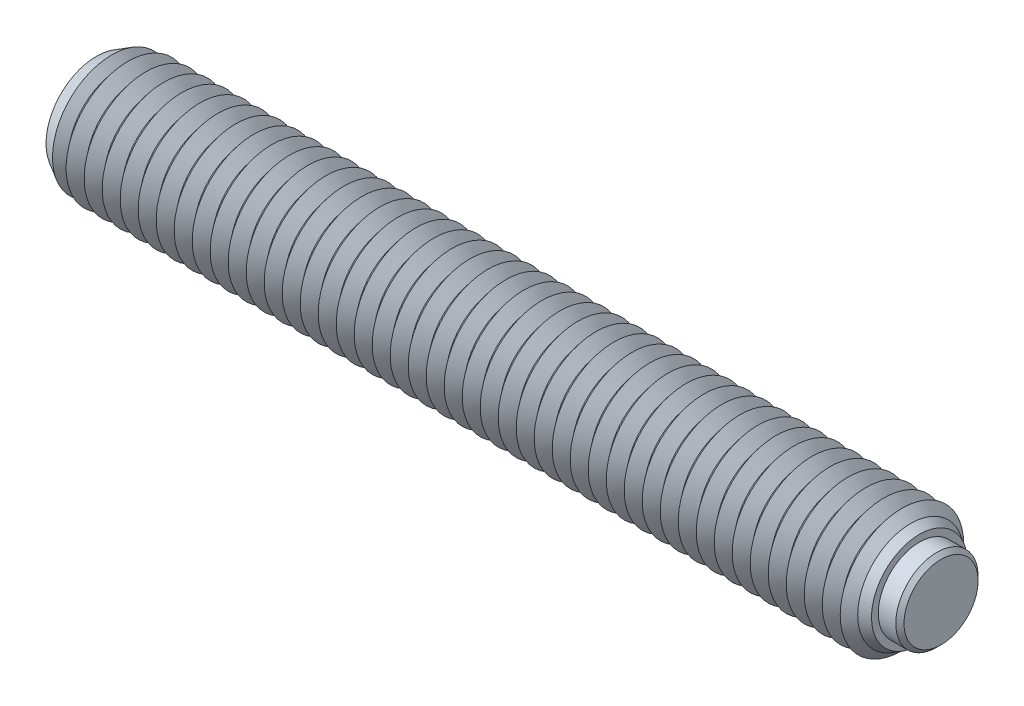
ISO-10303-21;
HEADER;
FILE_DESCRIPTION(('STEP AP214'),'2;1');
FILE_NAME('part.step','',(''),(''),'','','');
FILE_SCHEMA(('AUTOMOTIVE_DESIGN { 1 0 10303 214 1 1 1 1 }'));
ENDSEC;
DATA;
#1=APPLICATION_CONTEXT('core data for automotive mechanical design processes');
#2=APPLICATION_PROTOCOL_DEFINITION('international standard','automotive_design',2000,#1);
#3=PRODUCT_CONTEXT('',#1,'mechanical');
#4=PRODUCT('Part','Part','',(#3));
#5=PRODUCT_RELATED_PRODUCT_CATEGORY('part','',(#4));
#6=PRODUCT_DEFINITION_FORMATION('','',#4);
#7=PRODUCT_DEFINITION_CONTEXT('part definition',#1,'design');
#8=PRODUCT_DEFINITION('design','',#6,#7);
#9=PRODUCT_DEFINITION_SHAPE('','',#8);
#10=(LENGTH_UNIT() NAMED_UNIT(*) SI_UNIT(.MILLI.,.METRE.));
#11=(NAMED_UNIT(*) PLANE_ANGLE_UNIT() SI_UNIT($,.RADIAN.));
#12=(NAMED_UNIT(*) SI_UNIT($,.STERADIAN.) SOLID_ANGLE_UNIT());
#13=UNCERTAINTY_MEASURE_WITH_UNIT(LENGTH_MEASURE(1.E-05),#10,'distance_accuracy_value','');
#14=(GEOMETRIC_REPRESENTATION_CONTEXT(3) GLOBAL_UNCERTAINTY_ASSIGNED_CONTEXT((#13)) GLOBAL_UNIT_ASSIGNED_CONTEXT((#10,
#11,#12)) REPRESENTATION_CONTEXT('',''));
#15=CARTESIAN_POINT('',(0.,0.,0.));
#16=DIRECTION('',(0.,0.,1.));
#17=DIRECTION('',(1.,0.,0.));
#18=AXIS2_PLACEMENT_3D('',#15,#16,#17);
#19=CARTESIAN_POINT('',(2.95,0.,0.));
#20=DIRECTION('',(-1.,0.,0.));
#21=DIRECTION('',(0.,0.,1.));
#22=AXIS2_PLACEMENT_3D('',#19,#20,#21);
#23=CYLINDRICAL_SURFACE('',#22,4.);
#24=CARTESIAN_POINT('',(2.55,0.,0.));
#25=DIRECTION('',(1.,0.,0.));
#26=DIRECTION('',(0.,0.,-1.));
#27=AXIS2_PLACEMENT_3D('',#24,#25,#26);
#28=CIRCLE('',#27,4.);
#29=CARTESIAN_POINT('',(2.55,0.,4.));
#30=VERTEX_POINT('',#29);
#31=EDGE_CURVE('P0_E10',#30,#30,#28,.F.);
#32=ORIENTED_EDGE('',*,*,#31,.T.);
#33=EDGE_LOOP('',(#32));
#34=FACE_BOUND('',#33,.T.);
#35=CARTESIAN_POINT('',(-1.25,0.,0.));
#36=DIRECTION('',(1.,0.,0.));
#37=DIRECTION('',(0.,0.,-1.));
#38=AXIS2_PLACEMENT_3D('',#35,#36,#37);
#39=CIRCLE('',#38,4.);
#40=CARTESIAN_POINT('',(-1.25,0.,-4.));
#41=VERTEX_POINT('',#40);
#42=EDGE_CURVE('P0_E25',#41,#41,#39,.T.);
#43=ORIENTED_EDGE('',*,*,#42,.T.);
#44=EDGE_LOOP('',(#43));
#45=FACE_BOUND('',#44,.T.);
#46=ADVANCED_FACE('P0_F14',(#34,#45),#23,.T.);
#47=CARTESIAN_POINT('',(2.95,0.,0.));
#48=DIRECTION('',(1.,0.,0.));
#49=DIRECTION('',(0.,0.,-1.));
#50=AXIS2_PLACEMENT_3D('',#47,#48,#49);
#51=PLANE('',#50);
#52=CARTESIAN_POINT('',(2.95,0.,0.));
#53=DIRECTION('',(1.,0.,0.));
#54=DIRECTION('',(0.,0.,-1.));
#55=AXIS2_PLACEMENT_3D('',#52,#53,#54);
#56=CIRCLE('',#55,3.6);
#57=CARTESIAN_POINT('',(2.95,0.,3.6));
#58=VERTEX_POINT('',#57);
#59=EDGE_CURVE('P0_E21',#58,#58,#56,.T.);
#60=ORIENTED_EDGE('',*,*,#59,.T.);
#61=EDGE_LOOP('',(#60));
#62=FACE_BOUND('',#61,.T.);
#63=ADVANCED_FACE('P0_F35',(#62),#51,.T.);
#64=CARTESIAN_POINT('',(-1.25,0.,0.));
#65=DIRECTION('',(1.,0.,0.));
#66=DIRECTION('',(0.,0.,-1.));
#67=AXIS2_PLACEMENT_3D('',#64,#65,#66);
#68=PLANE('',#67);
#69=ORIENTED_EDGE('',*,*,#42,.F.);
#70=EDGE_LOOP('',(#69));
#71=FACE_BOUND('',#70,.T.);
#72=ADVANCED_FACE('P0_F33',(#71),#68,.F.);
#73=CARTESIAN_POINT('',(2.95,0.,0.));
#74=DIRECTION('',(-1.,0.,0.));
#75=DIRECTION('',(0.,0.,1.));
#76=AXIS2_PLACEMENT_3D('',#73,#74,#75);
#77=CONICAL_SURFACE('',#76,3.6,0.785398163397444);
#78=CARTESIAN_POINT('',(2.55,0.,4.));
#79=CARTESIAN_POINT('',(2.55416666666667,0.,3.99583333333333));
#80=CARTESIAN_POINT('',(2.55833333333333,0.,3.99166666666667));
#81=CARTESIAN_POINT('',(2.56666666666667,0.,3.98333333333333));
#82=CARTESIAN_POINT('',(2.57083333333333,0.,3.97916666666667));
#83=CARTESIAN_POINT('',(2.57916666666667,0.,3.97083333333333));
#84=CARTESIAN_POINT('',(2.58333333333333,0.,3.96666666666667));
#85=CARTESIAN_POINT('',(2.59166666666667,0.,3.95833333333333));
#86=CARTESIAN_POINT('',(2.59583333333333,0.,3.95416666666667));
#87=CARTESIAN_POINT('',(2.60416666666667,0.,3.94583333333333));
#88=CARTESIAN_POINT('',(2.60833333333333,0.,3.94166666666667));
#89=CARTESIAN_POINT('',(2.61666666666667,0.,3.93333333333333));
#90=CARTESIAN_POINT('',(2.62083333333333,0.,3.92916666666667));
#91=CARTESIAN_POINT('',(2.62916666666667,0.,3.92083333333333));
#92=CARTESIAN_POINT('',(2.63333333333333,0.,3.91666666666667));
#93=CARTESIAN_POINT('',(2.64166666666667,0.,3.90833333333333));
#94=CARTESIAN_POINT('',(2.64583333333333,0.,3.90416666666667));
#95=CARTESIAN_POINT('',(2.65416666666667,0.,3.89583333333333));
#96=CARTESIAN_POINT('',(2.65833333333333,0.,3.89166666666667));
#97=CARTESIAN_POINT('',(2.66666666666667,0.,3.88333333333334));
#98=CARTESIAN_POINT('',(2.67083333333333,0.,3.87916666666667));
#99=CARTESIAN_POINT('',(2.67916666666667,0.,3.87083333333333));
#100=CARTESIAN_POINT('',(2.68333333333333,0.,3.86666666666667));
#101=CARTESIAN_POINT('',(2.69166666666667,0.,3.85833333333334));
#102=CARTESIAN_POINT('',(2.69583333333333,0.,3.85416666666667));
#103=CARTESIAN_POINT('',(2.70416666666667,0.,3.84583333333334));
#104=CARTESIAN_POINT('',(2.70833333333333,0.,3.84166666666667));
#105=CARTESIAN_POINT('',(2.71666666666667,0.,3.83333333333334));
#106=CARTESIAN_POINT('',(2.72083333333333,0.,3.82916666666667));
#107=CARTESIAN_POINT('',(2.72916666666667,0.,3.82083333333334));
#108=CARTESIAN_POINT('',(2.73333333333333,0.,3.81666666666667));
#109=CARTESIAN_POINT('',(2.74166666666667,0.,3.80833333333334));
#110=CARTESIAN_POINT('',(2.74583333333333,0.,3.80416666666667));
#111=CARTESIAN_POINT('',(2.75416666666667,0.,3.79583333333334));
#112=CARTESIAN_POINT('',(2.75833333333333,0.,3.79166666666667));
#113=CARTESIAN_POINT('',(2.76666666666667,0.,3.78333333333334));
#114=CARTESIAN_POINT('',(2.77083333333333,0.,3.77916666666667));
#115=CARTESIAN_POINT('',(2.77916666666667,0.,3.77083333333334));
#116=CARTESIAN_POINT('',(2.78333333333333,0.,3.76666666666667));
#117=CARTESIAN_POINT('',(2.79166666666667,0.,3.75833333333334));
#118=CARTESIAN_POINT('',(2.79583333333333,0.,3.75416666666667));
#119=CARTESIAN_POINT('',(2.80416666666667,0.,3.74583333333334));
#120=CARTESIAN_POINT('',(2.80833333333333,0.,3.74166666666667));
#121=CARTESIAN_POINT('',(2.81666666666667,0.,3.73333333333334));
#122=CARTESIAN_POINT('',(2.82083333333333,0.,3.72916666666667));
#123=CARTESIAN_POINT('',(2.82916666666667,0.,3.72083333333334));
#124=CARTESIAN_POINT('',(2.83333333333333,0.,3.71666666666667));
#125=CARTESIAN_POINT('',(2.84166666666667,0.,3.70833333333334));
#126=CARTESIAN_POINT('',(2.84583333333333,0.,3.70416666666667));
#127=CARTESIAN_POINT('',(2.85416666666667,0.,3.69583333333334));
#128=CARTESIAN_POINT('',(2.85833333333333,0.,3.69166666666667));
#129=CARTESIAN_POINT('',(2.86666666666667,0.,3.68333333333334));
#130=CARTESIAN_POINT('',(2.87083333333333,0.,3.67916666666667));
#131=CARTESIAN_POINT('',(2.87916666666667,0.,3.67083333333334));
#132=CARTESIAN_POINT('',(2.88333333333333,0.,3.66666666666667));
#133=CARTESIAN_POINT('',(2.89166666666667,0.,3.65833333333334));
#134=CARTESIAN_POINT('',(2.89583333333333,0.,3.65416666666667));
#135=CARTESIAN_POINT('',(2.90416666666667,0.,3.64583333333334));
#136=CARTESIAN_POINT('',(2.90833333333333,0.,3.64166666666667));
#137=CARTESIAN_POINT('',(2.91666666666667,0.,3.63333333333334));
#138=CARTESIAN_POINT('',(2.92083333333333,0.,3.62916666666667));
#139=CARTESIAN_POINT('',(2.92916666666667,0.,3.62083333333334));
#140=CARTESIAN_POINT('',(2.93333333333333,0.,3.61666666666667));
#141=CARTESIAN_POINT('',(2.94166666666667,0.,3.60833333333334));
#142=CARTESIAN_POINT('',(2.94583333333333,0.,3.60416666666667));
#143=CARTESIAN_POINT('',(2.95,0.,3.6));
#144=B_SPLINE_CURVE_WITH_KNOTS('',3,(#78,#79,#80,#81,#82,#83,#84,#85,#86,#87,#88,#89,#90,#91,
#92,#93,#94,#95,#96,#97,#98,#99,#100,#101,#102,#103,#104,#105,#106,#107,#108,#109,#110,#111,
#112,#113,#114,#115,#116,#117,#118,#119,#120,#121,#122,#123,#124,#125,#126,#127,#128,#129,#130,
#131,#132,#133,#134,#135,#136,#137,#138,#139,#140,#141,#142,#143),.UNSPECIFIED.,.F.,.F.,(4,2,2,
2,2,2,2,2,2,2,2,2,2,2,2,2,2,2,2,2,2,2,2,2,2,2,2,2,2,2,2,2,4),(0.,0.0176776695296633,
0.0353553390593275,0.0530330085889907,0.070710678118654,0.0883883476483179,0.106066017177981,
0.123743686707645,0.141421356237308,0.159099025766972,0.176776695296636,0.194454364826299,
0.212132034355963,0.229809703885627,0.24748737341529,0.265165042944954,0.282842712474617,
0.300520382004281,0.318198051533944,0.335875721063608,0.353553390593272,0.371231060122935,
0.388908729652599,0.406586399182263,0.424264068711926,0.44194173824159,0.459619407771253,
0.477297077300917,0.49497474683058,0.512652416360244,0.530330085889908,0.548007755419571,
0.565685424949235),.UNSPECIFIED.);
#145=EDGE_CURVE('P0_BSEAM16',#30,#58,#144,.T.);
#146=ORIENTED_EDGE('',*,*,#31,.F.);
#147=ORIENTED_EDGE('',*,*,#59,.F.);
#148=ORIENTED_EDGE('',*,*,#145,.T.);
#149=ORIENTED_EDGE('',*,*,#145,.F.);
#150=EDGE_LOOP('',(#146,#148,#147,#149));
#151=FACE_BOUND('',#150,.T.);
#152=ADVANCED_FACE('P0_F16',(#151),#77,.T.);
#153=CLOSED_SHELL('',(#46,#63,#72,#152));
#154=MANIFOLD_SOLID_BREP('P0_B1',#153);
#155=CARTESIAN_POINT('',(-77.85,0.,0.));
#156=DIRECTION('',(-1.,0.,0.));
#157=DIRECTION('',(0.,0.,1.));
#158=AXIS2_PLACEMENT_3D('',#155,#156,#157);
#159=CONICAL_SURFACE('',#158,6.,0.895664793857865);
#160=CARTESIAN_POINT('',(-76.975,0.,0.));
#161=DIRECTION('',(1.,0.,0.));
#162=DIRECTION('',(0.,0.,-1.));
#163=AXIS2_PLACEMENT_3D('',#160,#161,#162);
#164=CIRCLE('',#163,4.90712535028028);
#165=CARTESIAN_POINT('',(-76.975,0.,-4.90712535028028));
#166=VERTEX_POINT('',#165);
#167=EDGE_CURVE('P1_E1633',#166,#166,#164,.T.);
#168=ORIENTED_EDGE('',*,*,#167,.F.);
#169=EDGE_LOOP('',(#168));
#170=FACE_BOUND('',#169,.T.);
#171=CARTESIAN_POINT('',(-77.6625664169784,0.,0.));
#172=DIRECTION('',(1.,0.,0.));
#173=DIRECTION('',(0.,0.,-1.));
#174=AXIS2_PLACEMENT_3D('',#171,#172,#173);
#175=CIRCLE('',#174,5.7658955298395);
#176=CARTESIAN_POINT('',(-77.6625664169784,0.,-5.7658955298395));
#177=VERTEX_POINT('',#176);
#178=EDGE_CURVE('P1_E1636',#177,#177,#175,.F.);
#179=ORIENTED_EDGE('',*,*,#178,.F.);
#180=EDGE_LOOP('',(#179));
#181=FACE_BOUND('',#180,.T.);
#182=ADVANCED_FACE('P1_F15',(#170,#181),#159,.T.);
#183=CARTESIAN_POINT('',(-1.725,0.,0.));
#184=DIRECTION('',(1.,0.,0.));
#185=DIRECTION('',(0.,0.,-1.));
#186=AXIS2_PLACEMENT_3D('',#183,#184,#185);
#187=CONICAL_SURFACE('',#186,4.90712535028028,0.895664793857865);
#188=CARTESIAN_POINT('',(-0.850000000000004,0.,0.));
#189=DIRECTION('',(1.,0.,0.));
#190=DIRECTION('',(0.,0.,-1.));
#191=AXIS2_PLACEMENT_3D('',#188,#189,#190);
#192=CIRCLE('',#191,6.);
#193=CARTESIAN_POINT('',(-0.850000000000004,0.,6.));
#194=VERTEX_POINT('',#193);
#195=EDGE_CURVE('P1_E1371',#194,#194,#192,.T.);
#196=ORIENTED_EDGE('',*,*,#195,.F.);
#197=EDGE_LOOP('',(#196));
#198=FACE_BOUND('',#197,.T.);
#199=CARTESIAN_POINT('',(-1.725,0.,0.));
#200=DIRECTION('',(1.,0.,0.));
#201=DIRECTION('',(0.,0.,-1.));
#202=AXIS2_PLACEMENT_3D('',#199,#200,#201);
#203=CIRCLE('',#202,4.90712535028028);
#204=CARTESIAN_POINT('',(-1.725,0.,-4.90712535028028));
#205=VERTEX_POINT('',#204);
#206=EDGE_CURVE('P1_E1372',#205,#205,#203,.T.);
#207=ORIENTED_EDGE('',*,*,#206,.T.);
#208=EDGE_LOOP('',(#207));
#209=FACE_BOUND('',#208,.T.);
#210=ADVANCED_FACE('P1_F222',(#198,#209),#187,.T.);
#211=CARTESIAN_POINT('',(-2.6,0.,0.));
#212=DIRECTION('',(-1.,0.,0.));
#213=DIRECTION('',(0.,0.,1.));
#214=AXIS2_PLACEMENT_3D('',#211,#212,#213);
#215=CONICAL_SURFACE('',#214,6.,0.895664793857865);
#216=ORIENTED_EDGE('',*,*,#206,.F.);
#217=EDGE_LOOP('',(#216));
#218=FACE_BOUND('',#217,.T.);
#219=CARTESIAN_POINT('',(-2.6,0.,0.));
#220=DIRECTION('',(1.,0.,0.));
#221=DIRECTION('',(0.,0.,-1.));
#222=AXIS2_PLACEMENT_3D('',#219,#220,#221);
#223=CIRCLE('',#222,6.);
#224=CARTESIAN_POINT('',(-2.6,0.,-6.));
#225=VERTEX_POINT('',#224);
#226=EDGE_CURVE('P1_E1376',#225,#225,#223,.T.);
#227=ORIENTED_EDGE('',*,*,#226,.T.);
#228=EDGE_LOOP('',(#227));
#229=FACE_BOUND('',#228,.T.);
#230=ADVANCED_FACE('P1_F227',(#218,#229),#215,.T.);
#231=CARTESIAN_POINT('',(-1.25,0.,0.));
#232=DIRECTION('',(1.,0.,0.));
#233=DIRECTION('',(0.,1.,0.));
#234=AXIS2_PLACEMENT_3D('',#231,#232,#233);
#235=PLANE('',#234);
#236=CARTESIAN_POINT('',(-1.25,0.,0.));
#237=DIRECTION('',(1.,0.,0.));
#238=DIRECTION('',(0.,1.,0.));
#239=AXIS2_PLACEMENT_3D('',#236,#237,#238);
#240=CIRCLE('',#239,4.);
#241=CARTESIAN_POINT('',(-1.25,4.,0.));
#242=VERTEX_POINT('',#241);
#243=EDGE_CURVE('P1_E646',#242,#242,#240,.T.);
#244=ORIENTED_EDGE('',*,*,#243,.T.);
#245=EDGE_LOOP('',(#244));
#246=FACE_BOUND('',#245,.T.);
#247=ADVANCED_FACE('P1_F573',(#246),#235,.T.);
#248=CARTESIAN_POINT('',(-1.25,0.,0.));
#249=DIRECTION('',(1.,0.,0.));
#250=DIRECTION('',(0.,1.,0.));
#251=AXIS2_PLACEMENT_3D('',#248,#249,#250);
#252=CYLINDRICAL_SURFACE('',#251,4.);
#253=ORIENTED_EDGE('',*,*,#243,.F.);
#254=EDGE_LOOP('',(#253));
#255=FACE_BOUND('',#254,.T.);
#256=CARTESIAN_POINT('',(0.85,0.,0.));
#257=DIRECTION('',(1.,0.,0.));
#258=DIRECTION('',(0.,1.,0.));
#259=AXIS2_PLACEMENT_3D('',#256,#257,#258);
#260=CIRCLE('',#259,4.);
#261=CARTESIAN_POINT('',(0.85,4.,0.));
#262=VERTEX_POINT('',#261);
#263=EDGE_CURVE('P1_E649',#262,#262,#260,.T.);
#264=ORIENTED_EDGE('',*,*,#263,.T.);
#265=EDGE_LOOP('',(#264));
#266=FACE_BOUND('',#265,.T.);
#267=ADVANCED_FACE('P1_F209',(#255,#266),#252,.F.);
#268=CARTESIAN_POINT('',(0.849999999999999,4.65925227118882,0.));
#269=DIRECTION('',(1.,0.,0.));
#270=DIRECTION('',(0.,1.,0.));
#271=AXIS2_PLACEMENT_3D('',#268,#269,#270);
#272=PLANE('',#271);
#273=ORIENTED_EDGE('',*,*,#263,.F.);
#274=EDGE_LOOP('',(#273));
#275=FACE_BOUND('',#274,.T.);
#276=CARTESIAN_POINT('',(0.85,0.,0.));
#277=DIRECTION('',(1.,0.,0.));
#278=DIRECTION('',(0.,1.,0.));
#279=AXIS2_PLACEMENT_3D('',#276,#277,#278);
#280=CIRCLE('',#279,4.65925227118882);
#281=CARTESIAN_POINT('',(0.849999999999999,4.65925227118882,0.));
#282=VERTEX_POINT('',#281);
#283=EDGE_CURVE('P1_E121',#282,#282,#280,.T.);
#284=ORIENTED_EDGE('',*,*,#283,.T.);
#285=EDGE_LOOP('',(#284));
#286=FACE_BOUND('',#285,.T.);
#287=ADVANCED_FACE('P1_F206',(#275,#286),#272,.T.);
#288=CARTESIAN_POINT('',(0.85,0.,0.));
#289=DIRECTION('',(-1.,0.,0.));
#290=DIRECTION('',(0.,-1.,0.));
#291=AXIS2_PLACEMENT_3D('',#288,#289,#290);
#292=CONICAL_SURFACE('',#291,4.65925227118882,0.523598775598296);
#293=CARTESIAN_POINT('',(0.,0.,0.));
#294=DIRECTION('',(1.,0.,0.));
#295=DIRECTION('',(0.,0.,-1.));
#296=AXIS2_PLACEMENT_3D('',#293,#294,#295);
#297=CIRCLE('',#296,5.15);
#298=CARTESIAN_POINT('',(0.,0.,5.15));
#299=VERTEX_POINT('',#298);
#300=EDGE_CURVE('P1_E637',#299,#299,#297,.T.);
#301=ORIENTED_EDGE('',*,*,#300,.T.);
#302=EDGE_LOOP('',(#301));
#303=FACE_BOUND('',#302,.T.);
#304=ORIENTED_EDGE('',*,*,#283,.F.);
#305=EDGE_LOOP('',(#304));
#306=FACE_BOUND('',#305,.T.);
#307=ADVANCED_FACE('P1_F203',(#303,#306),#292,.T.);
#308=CARTESIAN_POINT('',(0.,0.,0.));
#309=DIRECTION('',(-1.,0.,0.));
#310=DIRECTION('',(0.,0.,1.));
#311=AXIS2_PLACEMENT_3D('',#308,#309,#310);
#312=CONICAL_SURFACE('',#311,5.15,0.785398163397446);
#313=CARTESIAN_POINT('',(-0.850000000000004,0.,6.));
#314=CARTESIAN_POINT('',(-0.841145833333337,0.,5.99114583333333));
#315=CARTESIAN_POINT('',(-0.83229166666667,0.,5.98229166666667));
#316=CARTESIAN_POINT('',(-0.814583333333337,0.,5.96458333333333));
#317=CARTESIAN_POINT('',(-0.80572916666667,0.,5.95572916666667));
#318=CARTESIAN_POINT('',(-0.788020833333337,0.,5.93802083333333));
#319=CARTESIAN_POINT('',(-0.77916666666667,0.,5.92916666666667));
#320=CARTESIAN_POINT('',(-0.761458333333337,0.,5.91145833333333));
#321=CARTESIAN_POINT('',(-0.75260416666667,0.,5.90260416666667));
#322=CARTESIAN_POINT('',(-0.734895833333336,0.,5.88489583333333));
#323=CARTESIAN_POINT('',(-0.72604166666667,0.,5.87604166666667));
#324=CARTESIAN_POINT('',(-0.708333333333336,0.,5.85833333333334));
#325=CARTESIAN_POINT('',(-0.69947916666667,0.,5.84947916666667));
#326=CARTESIAN_POINT('',(-0.681770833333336,0.,5.83177083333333));
#327=CARTESIAN_POINT('',(-0.67291666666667,0.,5.82291666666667));
#328=CARTESIAN_POINT('',(-0.655208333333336,0.,5.80520833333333));
#329=CARTESIAN_POINT('',(-0.646354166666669,0.,5.79635416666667));
#330=CARTESIAN_POINT('',(-0.628645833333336,0.,5.77864583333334));
#331=CARTESIAN_POINT('',(-0.619791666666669,0.,5.76979166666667));
#332=CARTESIAN_POINT('',(-0.602083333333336,0.,5.75208333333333));
#333=CARTESIAN_POINT('',(-0.593229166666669,0.,5.74322916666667));
#334=CARTESIAN_POINT('',(-0.575520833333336,0.,5.72552083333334));
#335=CARTESIAN_POINT('',(-0.566666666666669,0.,5.71666666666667));
#336=CARTESIAN_POINT('',(-0.548958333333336,0.,5.69895833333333));
#337=CARTESIAN_POINT('',(-0.540104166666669,0.,5.69010416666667));
#338=CARTESIAN_POINT('',(-0.522395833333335,0.,5.67239583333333));
#339=CARTESIAN_POINT('',(-0.513541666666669,0.,5.66354166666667));
#340=CARTESIAN_POINT('',(-0.495833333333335,0.,5.64583333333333));
#341=CARTESIAN_POINT('',(-0.486979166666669,0.,5.63697916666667));
#342=CARTESIAN_POINT('',(-0.469270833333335,0.,5.61927083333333));
#343=CARTESIAN_POINT('',(-0.460416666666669,0.,5.61041666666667));
#344=CARTESIAN_POINT('',(-0.442708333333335,0.,5.59270833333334));
#345=CARTESIAN_POINT('',(-0.433854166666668,0.,5.58385416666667));
#346=CARTESIAN_POINT('',(-0.416145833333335,0.,5.56614583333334));
#347=CARTESIAN_POINT('',(-0.407291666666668,0.,5.55729166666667));
#348=CARTESIAN_POINT('',(-0.389583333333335,0.,5.53958333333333));
#349=CARTESIAN_POINT('',(-0.380729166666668,0.,5.53072916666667));
#350=CARTESIAN_POINT('',(-0.363020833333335,0.,5.51302083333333));
#351=CARTESIAN_POINT('',(-0.354166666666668,0.,5.50416666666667));
#352=CARTESIAN_POINT('',(-0.336458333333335,0.,5.48645833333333));
#353=CARTESIAN_POINT('',(-0.327604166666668,0.,5.47760416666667));
#354=CARTESIAN_POINT('',(-0.309895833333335,0.,5.45989583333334));
#355=CARTESIAN_POINT('',(-0.301041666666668,0.,5.45104166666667));
#356=CARTESIAN_POINT('',(-0.283333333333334,0.,5.43333333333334));
#357=CARTESIAN_POINT('',(-0.274479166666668,0.,5.42447916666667));
#358=CARTESIAN_POINT('',(-0.256770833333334,0.,5.40677083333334));
#359=CARTESIAN_POINT('',(-0.247916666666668,0.,5.39791666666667));
#360=CARTESIAN_POINT('',(-0.230208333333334,0.,5.38020833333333));
#361=CARTESIAN_POINT('',(-0.221354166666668,0.,5.37135416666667));
#362=CARTESIAN_POINT('',(-0.203645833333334,0.,5.35364583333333));
#363=CARTESIAN_POINT('',(-0.194791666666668,0.,5.34479166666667));
#364=CARTESIAN_POINT('',(-0.177083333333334,0.,5.32708333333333));
#365=CARTESIAN_POINT('',(-0.168229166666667,0.,5.31822916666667));
#366=CARTESIAN_POINT('',(-0.150520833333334,0.,5.30052083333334));
#367=CARTESIAN_POINT('',(-0.141666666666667,0.,5.29166666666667));
#368=CARTESIAN_POINT('',(-0.123958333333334,0.,5.27395833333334));
#369=CARTESIAN_POINT('',(-0.115104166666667,0.,5.26510416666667));
#370=CARTESIAN_POINT('',(-0.0973958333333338,0.,5.24739583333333));
#371=CARTESIAN_POINT('',(-0.0885416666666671,0.,5.23854166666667));
#372=CARTESIAN_POINT('',(-0.0708333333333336,0.,5.22083333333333));
#373=CARTESIAN_POINT('',(-0.0619791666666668,0.,5.21197916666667));
#374=CARTESIAN_POINT('',(-0.0442708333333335,0.,5.19427083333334));
#375=CARTESIAN_POINT('',(-0.0354166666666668,0.,5.18541666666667));
#376=CARTESIAN_POINT('',(-0.0177083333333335,0.,5.16770833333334));
#377=CARTESIAN_POINT('',(-0.0088541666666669,0.,5.15885416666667));
#378=CARTESIAN_POINT('',(0.,0.,5.15));
#379=B_SPLINE_CURVE_WITH_KNOTS('',3,(#313,#314,#315,#316,#317,#318,#319,#320,#321,#322,#323,
#324,#325,#326,#327,#328,#329,#330,#331,#332,#333,#334,#335,#336,#337,#338,#339,#340,#341,#342,
#343,#344,#345,#346,#347,#348,#349,#350,#351,#352,#353,#354,#355,#356,#357,#358,#359,#360,#361,
#362,#363,#364,#365,#366,#367,#368,#369,#370,#371,#372,#373,#374,#375,#376,#377,#378),
.UNSPECIFIED.,.F.,.F.,(4,2,2,2,2,2,2,2,2,2,2,2,2,2,2,2,2,2,2,2,2,2,2,2,2,2,2,2,2,2,2,2,4),(0.,
0.0375650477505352,0.0751300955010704,0.112695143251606,0.150260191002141,0.187825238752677,
0.225390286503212,0.262955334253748,0.300520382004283,0.338085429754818,0.375650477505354,
0.41321552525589,0.450780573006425,0.48834562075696,0.525910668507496,0.563475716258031,
0.601040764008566,0.638605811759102,0.676170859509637,0.713735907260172,0.751300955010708,
0.788866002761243,0.826431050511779,0.863996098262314,0.90156114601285,0.939126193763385,
0.976691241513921,1.01425628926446,1.05182133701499,1.08938638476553,1.12695143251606,
1.1645164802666,1.20208152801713),.UNSPECIFIED.);
#380=EDGE_CURVE('P1_BSEAM17',#194,#299,#379,.T.);
#381=ORIENTED_EDGE('',*,*,#195,.T.);
#382=ORIENTED_EDGE('',*,*,#300,.F.);
#383=ORIENTED_EDGE('',*,*,#380,.T.);
#384=ORIENTED_EDGE('',*,*,#380,.F.);
#385=EDGE_LOOP('',(#381,#383,#382,#384));
#386=FACE_BOUND('',#385,.T.);
#387=ADVANCED_FACE('P1_F17',(#386),#312,.T.);
#388=CARTESIAN_POINT('',(-3.475,0.,0.));
#389=DIRECTION('',(1.,0.,0.));
#390=DIRECTION('',(0.,0.,-1.));
#391=AXIS2_PLACEMENT_3D('',#388,#389,#390);
#392=CONICAL_SURFACE('',#391,4.90712535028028,0.895664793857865);
#393=ORIENTED_EDGE('',*,*,#226,.F.);
#394=EDGE_LOOP('',(#393));
#395=FACE_BOUND('',#394,.T.);
#396=CARTESIAN_POINT('',(-3.475,0.,0.));
#397=DIRECTION('',(1.,0.,0.));
#398=DIRECTION('',(0.,0.,-1.));
#399=AXIS2_PLACEMENT_3D('',#396,#397,#398);
#400=CIRCLE('',#399,4.90712535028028);
#401=CARTESIAN_POINT('',(-3.475,0.,-4.90712535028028));
#402=VERTEX_POINT('',#401);
#403=EDGE_CURVE('P1_E1381',#402,#402,#400,.T.);
#404=ORIENTED_EDGE('',*,*,#403,.T.);
#405=EDGE_LOOP('',(#404));
#406=FACE_BOUND('',#405,.T.);
#407=ADVANCED_FACE('P1_F567',(#395,#406),#392,.T.);
#408=CARTESIAN_POINT('',(-4.35,0.,0.));
#409=DIRECTION('',(-1.,0.,0.));
#410=DIRECTION('',(0.,0.,1.));
#411=AXIS2_PLACEMENT_3D('',#408,#409,#410);
#412=CONICAL_SURFACE('',#411,6.,0.895664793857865);
#413=ORIENTED_EDGE('',*,*,#403,.F.);
#414=EDGE_LOOP('',(#413));
#415=FACE_BOUND('',#414,.T.);
#416=CARTESIAN_POINT('',(-4.35,0.,0.));
#417=DIRECTION('',(1.,0.,0.));
#418=DIRECTION('',(0.,0.,-1.));
#419=AXIS2_PLACEMENT_3D('',#416,#417,#418);
#420=CIRCLE('',#419,6.);
#421=CARTESIAN_POINT('',(-4.35,0.,-6.));
#422=VERTEX_POINT('',#421);
#423=EDGE_CURVE('P1_E1384',#422,#422,#420,.T.);
#424=ORIENTED_EDGE('',*,*,#423,.T.);
#425=EDGE_LOOP('',(#424));
#426=FACE_BOUND('',#425,.T.);
#427=ADVANCED_FACE('P1_F563',(#415,#426),#412,.T.);
#428=CARTESIAN_POINT('',(-5.225,0.,0.));
#429=DIRECTION('',(1.,0.,0.));
#430=DIRECTION('',(0.,0.,-1.));
#431=AXIS2_PLACEMENT_3D('',#428,#429,#430);
#432=CONICAL_SURFACE('',#431,4.90712535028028,0.895664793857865);
#433=ORIENTED_EDGE('',*,*,#423,.F.);
#434=EDGE_LOOP('',(#433));
#435=FACE_BOUND('',#434,.T.);
#436=CARTESIAN_POINT('',(-5.225,0.,0.));
#437=DIRECTION('',(1.,0.,0.));
#438=DIRECTION('',(0.,0.,-1.));
#439=AXIS2_PLACEMENT_3D('',#436,#437,#438);
#440=CIRCLE('',#439,4.90712535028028);
#441=CARTESIAN_POINT('',(-5.225,0.,-4.90712535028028));
#442=VERTEX_POINT('',#441);
#443=EDGE_CURVE('P1_E1387',#442,#442,#440,.T.);
#444=ORIENTED_EDGE('',*,*,#443,.T.);
#445=EDGE_LOOP('',(#444));
#446=FACE_BOUND('',#445,.T.);
#447=ADVANCED_FACE('P1_F559',(#435,#446),#432,.T.);
#448=CARTESIAN_POINT('',(-6.1,0.,0.));
#449=DIRECTION('',(-1.,0.,0.));
#450=DIRECTION('',(0.,0.,1.));
#451=AXIS2_PLACEMENT_3D('',#448,#449,#450);
#452=CONICAL_SURFACE('',#451,6.,0.895664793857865);
#453=ORIENTED_EDGE('',*,*,#443,.F.);
#454=EDGE_LOOP('',(#453));
#455=FACE_BOUND('',#454,.T.);
#456=CARTESIAN_POINT('',(-6.1,0.,0.));
#457=DIRECTION('',(1.,0.,0.));
#458=DIRECTION('',(0.,0.,-1.));
#459=AXIS2_PLACEMENT_3D('',#456,#457,#458);
#460=CIRCLE('',#459,6.);
#461=CARTESIAN_POINT('',(-6.1,0.,-6.));
#462=VERTEX_POINT('',#461);
#463=EDGE_CURVE('P1_E1390',#462,#462,#460,.T.);
#464=ORIENTED_EDGE('',*,*,#463,.T.);
#465=EDGE_LOOP('',(#464));
#466=FACE_BOUND('',#465,.T.);
#467=ADVANCED_FACE('P1_F555',(#455,#466),#452,.T.);
#468=CARTESIAN_POINT('',(-6.975,0.,0.));
#469=DIRECTION('',(1.,0.,0.));
#470=DIRECTION('',(0.,0.,-1.));
#471=AXIS2_PLACEMENT_3D('',#468,#469,#470);
#472=CONICAL_SURFACE('',#471,4.90712535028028,0.895664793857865);
#473=ORIENTED_EDGE('',*,*,#463,.F.);
#474=EDGE_LOOP('',(#473));
#475=FACE_BOUND('',#474,.T.);
#476=CARTESIAN_POINT('',(-6.975,0.,0.));
#477=DIRECTION('',(1.,0.,0.));
#478=DIRECTION('',(0.,0.,-1.));
#479=AXIS2_PLACEMENT_3D('',#476,#477,#478);
#480=CIRCLE('',#479,4.90712535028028);
#481=CARTESIAN_POINT('',(-6.975,0.,-4.90712535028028));
#482=VERTEX_POINT('',#481);
#483=EDGE_CURVE('P1_E1393',#482,#482,#480,.T.);
#484=ORIENTED_EDGE('',*,*,#483,.T.);
#485=EDGE_LOOP('',(#484));
#486=FACE_BOUND('',#485,.T.);
#487=ADVANCED_FACE('P1_F551',(#475,#486),#472,.T.);
#488=CARTESIAN_POINT('',(-7.85,0.,0.));
#489=DIRECTION('',(-1.,0.,0.));
#490=DIRECTION('',(0.,0.,1.));
#491=AXIS2_PLACEMENT_3D('',#488,#489,#490);
#492=CONICAL_SURFACE('',#491,6.,0.895664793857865);
#493=ORIENTED_EDGE('',*,*,#483,.F.);
#494=EDGE_LOOP('',(#493));
#495=FACE_BOUND('',#494,.T.);
#496=CARTESIAN_POINT('',(-7.85,0.,0.));
#497=DIRECTION('',(1.,0.,0.));
#498=DIRECTION('',(0.,0.,-1.));
#499=AXIS2_PLACEMENT_3D('',#496,#497,#498);
#500=CIRCLE('',#499,6.);
#501=CARTESIAN_POINT('',(-7.85,0.,-6.));
#502=VERTEX_POINT('',#501);
#503=EDGE_CURVE('P1_E1396',#502,#502,#500,.T.);
#504=ORIENTED_EDGE('',*,*,#503,.T.);
#505=EDGE_LOOP('',(#504));
#506=FACE_BOUND('',#505,.T.);
#507=ADVANCED_FACE('P1_F547',(#495,#506),#492,.T.);
#508=CARTESIAN_POINT('',(-8.725,0.,0.));
#509=DIRECTION('',(1.,0.,0.));
#510=DIRECTION('',(0.,0.,-1.));
#511=AXIS2_PLACEMENT_3D('',#508,#509,#510);
#512=CONICAL_SURFACE('',#511,4.90712535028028,0.895664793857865);
#513=ORIENTED_EDGE('',*,*,#503,.F.);
#514=EDGE_LOOP('',(#513));
#515=FACE_BOUND('',#514,.T.);
#516=CARTESIAN_POINT('',(-8.725,0.,0.));
#517=DIRECTION('',(1.,0.,0.));
#518=DIRECTION('',(0.,0.,-1.));
#519=AXIS2_PLACEMENT_3D('',#516,#517,#518);
#520=CIRCLE('',#519,4.90712535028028);
#521=CARTESIAN_POINT('',(-8.725,0.,-4.90712535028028));
#522=VERTEX_POINT('',#521);
#523=EDGE_CURVE('P1_E1399',#522,#522,#520,.T.);
#524=ORIENTED_EDGE('',*,*,#523,.T.);
#525=EDGE_LOOP('',(#524));
#526=FACE_BOUND('',#525,.T.);
#527=ADVANCED_FACE('P1_F543',(#515,#526),#512,.T.);
#528=CARTESIAN_POINT('',(-9.6,0.,0.));
#529=DIRECTION('',(-1.,0.,0.));
#530=DIRECTION('',(0.,0.,1.));
#531=AXIS2_PLACEMENT_3D('',#528,#529,#530);
#532=CONICAL_SURFACE('',#531,6.,0.895664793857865);
#533=ORIENTED_EDGE('',*,*,#523,.F.);
#534=EDGE_LOOP('',(#533));
#535=FACE_BOUND('',#534,.T.);
#536=CARTESIAN_POINT('',(-9.6,0.,0.));
#537=DIRECTION('',(1.,0.,0.));
#538=DIRECTION('',(0.,0.,-1.));
#539=AXIS2_PLACEMENT_3D('',#536,#537,#538);
#540=CIRCLE('',#539,6.);
#541=CARTESIAN_POINT('',(-9.6,0.,-6.));
#542=VERTEX_POINT('',#541);
#543=EDGE_CURVE('P1_E1402',#542,#542,#540,.T.);
#544=ORIENTED_EDGE('',*,*,#543,.T.);
#545=EDGE_LOOP('',(#544));
#546=FACE_BOUND('',#545,.T.);
#547=ADVANCED_FACE('P1_F539',(#535,#546),#532,.T.);
#548=CARTESIAN_POINT('',(-10.475,0.,0.));
#549=DIRECTION('',(1.,0.,0.));
#550=DIRECTION('',(0.,0.,-1.));
#551=AXIS2_PLACEMENT_3D('',#548,#549,#550);
#552=CONICAL_SURFACE('',#551,4.90712535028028,0.895664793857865);
#553=ORIENTED_EDGE('',*,*,#543,.F.);
#554=EDGE_LOOP('',(#553));
#555=FACE_BOUND('',#554,.T.);
#556=CARTESIAN_POINT('',(-10.475,0.,0.));
#557=DIRECTION('',(1.,0.,0.));
#558=DIRECTION('',(0.,0.,-1.));
#559=AXIS2_PLACEMENT_3D('',#556,#557,#558);
#560=CIRCLE('',#559,4.90712535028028);
#561=CARTESIAN_POINT('',(-10.475,0.,-4.90712535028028));
#562=VERTEX_POINT('',#561);
#563=EDGE_CURVE('P1_E1405',#562,#562,#560,.T.);
#564=ORIENTED_EDGE('',*,*,#563,.T.);
#565=EDGE_LOOP('',(#564));
#566=FACE_BOUND('',#565,.T.);
#567=ADVANCED_FACE('P1_F535',(#555,#566),#552,.T.);
#568=CARTESIAN_POINT('',(-11.35,0.,0.));
#569=DIRECTION('',(-1.,0.,0.));
#570=DIRECTION('',(0.,0.,1.));
#571=AXIS2_PLACEMENT_3D('',#568,#569,#570);
#572=CONICAL_SURFACE('',#571,6.,0.895664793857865);
#573=ORIENTED_EDGE('',*,*,#563,.F.);
#574=EDGE_LOOP('',(#573));
#575=FACE_BOUND('',#574,.T.);
#576=CARTESIAN_POINT('',(-11.35,0.,0.));
#577=DIRECTION('',(1.,0.,0.));
#578=DIRECTION('',(0.,0.,-1.));
#579=AXIS2_PLACEMENT_3D('',#576,#577,#578);
#580=CIRCLE('',#579,6.);
#581=CARTESIAN_POINT('',(-11.35,0.,-6.));
#582=VERTEX_POINT('',#581);
#583=EDGE_CURVE('P1_E1408',#582,#582,#580,.T.);
#584=ORIENTED_EDGE('',*,*,#583,.T.);
#585=EDGE_LOOP('',(#584));
#586=FACE_BOUND('',#585,.T.);
#587=ADVANCED_FACE('P1_F531',(#575,#586),#572,.T.);
#588=CARTESIAN_POINT('',(-12.225,0.,0.));
#589=DIRECTION('',(1.,0.,0.));
#590=DIRECTION('',(0.,0.,-1.));
#591=AXIS2_PLACEMENT_3D('',#588,#589,#590);
#592=CONICAL_SURFACE('',#591,4.90712535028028,0.895664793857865);
#593=ORIENTED_EDGE('',*,*,#583,.F.);
#594=EDGE_LOOP('',(#593));
#595=FACE_BOUND('',#594,.T.);
#596=CARTESIAN_POINT('',(-12.225,0.,0.));
#597=DIRECTION('',(1.,0.,0.));
#598=DIRECTION('',(0.,0.,-1.));
#599=AXIS2_PLACEMENT_3D('',#596,#597,#598);
#600=CIRCLE('',#599,4.90712535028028);
#601=CARTESIAN_POINT('',(-12.225,0.,-4.90712535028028));
#602=VERTEX_POINT('',#601);
#603=EDGE_CURVE('P1_E1411',#602,#602,#600,.T.);
#604=ORIENTED_EDGE('',*,*,#603,.T.);
#605=EDGE_LOOP('',(#604));
#606=FACE_BOUND('',#605,.T.);
#607=ADVANCED_FACE('P1_F527',(#595,#606),#592,.T.);
#608=CARTESIAN_POINT('',(-13.1,0.,0.));
#609=DIRECTION('',(-1.,0.,0.));
#610=DIRECTION('',(0.,0.,1.));
#611=AXIS2_PLACEMENT_3D('',#608,#609,#610);
#612=CONICAL_SURFACE('',#611,6.,0.895664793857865);
#613=ORIENTED_EDGE('',*,*,#603,.F.);
#614=EDGE_LOOP('',(#613));
#615=FACE_BOUND('',#614,.T.);
#616=CARTESIAN_POINT('',(-13.1,0.,0.));
#617=DIRECTION('',(1.,0.,0.));
#618=DIRECTION('',(0.,0.,-1.));
#619=AXIS2_PLACEMENT_3D('',#616,#617,#618);
#620=CIRCLE('',#619,6.);
#621=CARTESIAN_POINT('',(-13.1,0.,-6.));
#622=VERTEX_POINT('',#621);
#623=EDGE_CURVE('P1_E1414',#622,#622,#620,.T.);
#624=ORIENTED_EDGE('',*,*,#623,.T.);
#625=EDGE_LOOP('',(#624));
#626=FACE_BOUND('',#625,.T.);
#627=ADVANCED_FACE('P1_F523',(#615,#626),#612,.T.);
#628=CARTESIAN_POINT('',(-13.975,0.,0.));
#629=DIRECTION('',(1.,0.,0.));
#630=DIRECTION('',(0.,0.,-1.));
#631=AXIS2_PLACEMENT_3D('',#628,#629,#630);
#632=CONICAL_SURFACE('',#631,4.90712535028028,0.895664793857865);
#633=ORIENTED_EDGE('',*,*,#623,.F.);
#634=EDGE_LOOP('',(#633));
#635=FACE_BOUND('',#634,.T.);
#636=CARTESIAN_POINT('',(-13.975,0.,0.));
#637=DIRECTION('',(1.,0.,0.));
#638=DIRECTION('',(0.,0.,-1.));
#639=AXIS2_PLACEMENT_3D('',#636,#637,#638);
#640=CIRCLE('',#639,4.90712535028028);
#641=CARTESIAN_POINT('',(-13.975,0.,-4.90712535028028));
#642=VERTEX_POINT('',#641);
#643=EDGE_CURVE('P1_E1417',#642,#642,#640,.T.);
#644=ORIENTED_EDGE('',*,*,#643,.T.);
#645=EDGE_LOOP('',(#644));
#646=FACE_BOUND('',#645,.T.);
#647=ADVANCED_FACE('P1_F519',(#635,#646),#632,.T.);
#648=CARTESIAN_POINT('',(-14.85,0.,0.));
#649=DIRECTION('',(-1.,0.,0.));
#650=DIRECTION('',(0.,0.,1.));
#651=AXIS2_PLACEMENT_3D('',#648,#649,#650);
#652=CONICAL_SURFACE('',#651,6.,0.895664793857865);
#653=ORIENTED_EDGE('',*,*,#643,.F.);
#654=EDGE_LOOP('',(#653));
#655=FACE_BOUND('',#654,.T.);
#656=CARTESIAN_POINT('',(-14.85,0.,0.));
#657=DIRECTION('',(1.,0.,0.));
#658=DIRECTION('',(0.,0.,-1.));
#659=AXIS2_PLACEMENT_3D('',#656,#657,#658);
#660=CIRCLE('',#659,6.);
#661=CARTESIAN_POINT('',(-14.85,0.,-6.));
#662=VERTEX_POINT('',#661);
#663=EDGE_CURVE('P1_E1420',#662,#662,#660,.T.);
#664=ORIENTED_EDGE('',*,*,#663,.T.);
#665=EDGE_LOOP('',(#664));
#666=FACE_BOUND('',#665,.T.);
#667=ADVANCED_FACE('P1_F515',(#655,#666),#652,.T.);
#668=CARTESIAN_POINT('',(-15.725,0.,0.));
#669=DIRECTION('',(1.,0.,0.));
#670=DIRECTION('',(0.,0.,-1.));
#671=AXIS2_PLACEMENT_3D('',#668,#669,#670);
#672=CONICAL_SURFACE('',#671,4.90712535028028,0.895664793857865);
#673=ORIENTED_EDGE('',*,*,#663,.F.);
#674=EDGE_LOOP('',(#673));
#675=FACE_BOUND('',#674,.T.);
#676=CARTESIAN_POINT('',(-15.725,0.,0.));
#677=DIRECTION('',(1.,0.,0.));
#678=DIRECTION('',(0.,0.,-1.));
#679=AXIS2_PLACEMENT_3D('',#676,#677,#678);
#680=CIRCLE('',#679,4.90712535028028);
#681=CARTESIAN_POINT('',(-15.725,0.,-4.90712535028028));
#682=VERTEX_POINT('',#681);
#683=EDGE_CURVE('P1_E1423',#682,#682,#680,.T.);
#684=ORIENTED_EDGE('',*,*,#683,.T.);
#685=EDGE_LOOP('',(#684));
#686=FACE_BOUND('',#685,.T.);
#687=ADVANCED_FACE('P1_F511',(#675,#686),#672,.T.);
#688=CARTESIAN_POINT('',(-16.6,0.,0.));
#689=DIRECTION('',(-1.,0.,0.));
#690=DIRECTION('',(0.,0.,1.));
#691=AXIS2_PLACEMENT_3D('',#688,#689,#690);
#692=CONICAL_SURFACE('',#691,6.,0.895664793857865);
#693=ORIENTED_EDGE('',*,*,#683,.F.);
#694=EDGE_LOOP('',(#693));
#695=FACE_BOUND('',#694,.T.);
#696=CARTESIAN_POINT('',(-16.6,0.,0.));
#697=DIRECTION('',(1.,0.,0.));
#698=DIRECTION('',(0.,0.,-1.));
#699=AXIS2_PLACEMENT_3D('',#696,#697,#698);
#700=CIRCLE('',#699,6.);
#701=CARTESIAN_POINT('',(-16.6,0.,-6.));
#702=VERTEX_POINT('',#701);
#703=EDGE_CURVE('P1_E1426',#702,#702,#700,.T.);
#704=ORIENTED_EDGE('',*,*,#703,.T.);
#705=EDGE_LOOP('',(#704));
#706=FACE_BOUND('',#705,.T.);
#707=ADVANCED_FACE('P1_F507',(#695,#706),#692,.T.);
#708=CARTESIAN_POINT('',(-17.475,0.,0.));
#709=DIRECTION('',(1.,0.,0.));
#710=DIRECTION('',(0.,0.,-1.));
#711=AXIS2_PLACEMENT_3D('',#708,#709,#710);
#712=CONICAL_SURFACE('',#711,4.90712535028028,0.895664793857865);
#713=ORIENTED_EDGE('',*,*,#703,.F.);
#714=EDGE_LOOP('',(#713));
#715=FACE_BOUND('',#714,.T.);
#716=CARTESIAN_POINT('',(-17.475,0.,0.));
#717=DIRECTION('',(1.,0.,0.));
#718=DIRECTION('',(0.,0.,-1.));
#719=AXIS2_PLACEMENT_3D('',#716,#717,#718);
#720=CIRCLE('',#719,4.90712535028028);
#721=CARTESIAN_POINT('',(-17.475,0.,-4.90712535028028));
#722=VERTEX_POINT('',#721);
#723=EDGE_CURVE('P1_E1429',#722,#722,#720,.T.);
#724=ORIENTED_EDGE('',*,*,#723,.T.);
#725=EDGE_LOOP('',(#724));
#726=FACE_BOUND('',#725,.T.);
#727=ADVANCED_FACE('P1_F503',(#715,#726),#712,.T.);
#728=CARTESIAN_POINT('',(-18.35,0.,0.));
#729=DIRECTION('',(-1.,0.,0.));
#730=DIRECTION('',(0.,0.,1.));
#731=AXIS2_PLACEMENT_3D('',#728,#729,#730);
#732=CONICAL_SURFACE('',#731,6.,0.895664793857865);
#733=ORIENTED_EDGE('',*,*,#723,.F.);
#734=EDGE_LOOP('',(#733));
#735=FACE_BOUND('',#734,.T.);
#736=CARTESIAN_POINT('',(-18.35,0.,0.));
#737=DIRECTION('',(1.,0.,0.));
#738=DIRECTION('',(0.,0.,-1.));
#739=AXIS2_PLACEMENT_3D('',#736,#737,#738);
#740=CIRCLE('',#739,6.);
#741=CARTESIAN_POINT('',(-18.35,0.,-6.));
#742=VERTEX_POINT('',#741);
#743=EDGE_CURVE('P1_E1432',#742,#742,#740,.T.);
#744=ORIENTED_EDGE('',*,*,#743,.T.);
#745=EDGE_LOOP('',(#744));
#746=FACE_BOUND('',#745,.T.);
#747=ADVANCED_FACE('P1_F499',(#735,#746),#732,.T.);
#748=CARTESIAN_POINT('',(-19.225,0.,0.));
#749=DIRECTION('',(1.,0.,0.));
#750=DIRECTION('',(0.,0.,-1.));
#751=AXIS2_PLACEMENT_3D('',#748,#749,#750);
#752=CONICAL_SURFACE('',#751,4.90712535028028,0.895664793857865);
#753=ORIENTED_EDGE('',*,*,#743,.F.);
#754=EDGE_LOOP('',(#753));
#755=FACE_BOUND('',#754,.T.);
#756=CARTESIAN_POINT('',(-19.225,0.,0.));
#757=DIRECTION('',(1.,0.,0.));
#758=DIRECTION('',(0.,0.,-1.));
#759=AXIS2_PLACEMENT_3D('',#756,#757,#758);
#760=CIRCLE('',#759,4.90712535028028);
#761=CARTESIAN_POINT('',(-19.225,0.,-4.90712535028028));
#762=VERTEX_POINT('',#761);
#763=EDGE_CURVE('P1_E1435',#762,#762,#760,.T.);
#764=ORIENTED_EDGE('',*,*,#763,.T.);
#765=EDGE_LOOP('',(#764));
#766=FACE_BOUND('',#765,.T.);
#767=ADVANCED_FACE('P1_F495',(#755,#766),#752,.T.);
#768=CARTESIAN_POINT('',(-20.1,0.,0.));
#769=DIRECTION('',(-1.,0.,0.));
#770=DIRECTION('',(0.,0.,1.));
#771=AXIS2_PLACEMENT_3D('',#768,#769,#770);
#772=CONICAL_SURFACE('',#771,6.,0.895664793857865);
#773=ORIENTED_EDGE('',*,*,#763,.F.);
#774=EDGE_LOOP('',(#773));
#775=FACE_BOUND('',#774,.T.);
#776=CARTESIAN_POINT('',(-20.1,0.,0.));
#777=DIRECTION('',(1.,0.,0.));
#778=DIRECTION('',(0.,0.,-1.));
#779=AXIS2_PLACEMENT_3D('',#776,#777,#778);
#780=CIRCLE('',#779,6.);
#781=CARTESIAN_POINT('',(-20.1,0.,-6.));
#782=VERTEX_POINT('',#781);
#783=EDGE_CURVE('P1_E1438',#782,#782,#780,.T.);
#784=ORIENTED_EDGE('',*,*,#783,.T.);
#785=EDGE_LOOP('',(#784));
#786=FACE_BOUND('',#785,.T.);
#787=ADVANCED_FACE('P1_F491',(#775,#786),#772,.T.);
#788=CARTESIAN_POINT('',(-20.975,0.,0.));
#789=DIRECTION('',(1.,0.,0.));
#790=DIRECTION('',(0.,0.,-1.));
#791=AXIS2_PLACEMENT_3D('',#788,#789,#790);
#792=CONICAL_SURFACE('',#791,4.90712535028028,0.895664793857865);
#793=ORIENTED_EDGE('',*,*,#783,.F.);
#794=EDGE_LOOP('',(#793));
#795=FACE_BOUND('',#794,.T.);
#796=CARTESIAN_POINT('',(-20.975,0.,0.));
#797=DIRECTION('',(1.,0.,0.));
#798=DIRECTION('',(0.,0.,-1.));
#799=AXIS2_PLACEMENT_3D('',#796,#797,#798);
#800=CIRCLE('',#799,4.90712535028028);
#801=CARTESIAN_POINT('',(-20.975,0.,-4.90712535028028));
#802=VERTEX_POINT('',#801);
#803=EDGE_CURVE('P1_E1441',#802,#802,#800,.T.);
#804=ORIENTED_EDGE('',*,*,#803,.T.);
#805=EDGE_LOOP('',(#804));
#806=FACE_BOUND('',#805,.T.);
#807=ADVANCED_FACE('P1_F487',(#795,#806),#792,.T.);
#808=CARTESIAN_POINT('',(-21.85,0.,0.));
#809=DIRECTION('',(-1.,0.,0.));
#810=DIRECTION('',(0.,0.,1.));
#811=AXIS2_PLACEMENT_3D('',#808,#809,#810);
#812=CONICAL_SURFACE('',#811,6.,0.895664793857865);
#813=ORIENTED_EDGE('',*,*,#803,.F.);
#814=EDGE_LOOP('',(#813));
#815=FACE_BOUND('',#814,.T.);
#816=CARTESIAN_POINT('',(-21.85,0.,0.));
#817=DIRECTION('',(1.,0.,0.));
#818=DIRECTION('',(0.,0.,-1.));
#819=AXIS2_PLACEMENT_3D('',#816,#817,#818);
#820=CIRCLE('',#819,6.);
#821=CARTESIAN_POINT('',(-21.85,0.,-6.));
#822=VERTEX_POINT('',#821);
#823=EDGE_CURVE('P1_E1444',#822,#822,#820,.T.);
#824=ORIENTED_EDGE('',*,*,#823,.T.);
#825=EDGE_LOOP('',(#824));
#826=FACE_BOUND('',#825,.T.);
#827=ADVANCED_FACE('P1_F483',(#815,#826),#812,.T.);
#828=CARTESIAN_POINT('',(-22.725,0.,0.));
#829=DIRECTION('',(1.,0.,0.));
#830=DIRECTION('',(0.,0.,-1.));
#831=AXIS2_PLACEMENT_3D('',#828,#829,#830);
#832=CONICAL_SURFACE('',#831,4.90712535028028,0.895664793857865);
#833=ORIENTED_EDGE('',*,*,#823,.F.);
#834=EDGE_LOOP('',(#833));
#835=FACE_BOUND('',#834,.T.);
#836=CARTESIAN_POINT('',(-22.725,0.,0.));
#837=DIRECTION('',(1.,0.,0.));
#838=DIRECTION('',(0.,0.,-1.));
#839=AXIS2_PLACEMENT_3D('',#836,#837,#838);
#840=CIRCLE('',#839,4.90712535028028);
#841=CARTESIAN_POINT('',(-22.725,0.,-4.90712535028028));
#842=VERTEX_POINT('',#841);
#843=EDGE_CURVE('P1_E1447',#842,#842,#840,.T.);
#844=ORIENTED_EDGE('',*,*,#843,.T.);
#845=EDGE_LOOP('',(#844));
#846=FACE_BOUND('',#845,.T.);
#847=ADVANCED_FACE('P1_F479',(#835,#846),#832,.T.);
#848=CARTESIAN_POINT('',(-23.6,0.,0.));
#849=DIRECTION('',(-1.,0.,0.));
#850=DIRECTION('',(0.,0.,1.));
#851=AXIS2_PLACEMENT_3D('',#848,#849,#850);
#852=CONICAL_SURFACE('',#851,6.,0.895664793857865);
#853=ORIENTED_EDGE('',*,*,#843,.F.);
#854=EDGE_LOOP('',(#853));
#855=FACE_BOUND('',#854,.T.);
#856=CARTESIAN_POINT('',(-23.6,0.,0.));
#857=DIRECTION('',(1.,0.,0.));
#858=DIRECTION('',(0.,0.,-1.));
#859=AXIS2_PLACEMENT_3D('',#856,#857,#858);
#860=CIRCLE('',#859,6.);
#861=CARTESIAN_POINT('',(-23.6,0.,-6.));
#862=VERTEX_POINT('',#861);
#863=EDGE_CURVE('P1_E1450',#862,#862,#860,.T.);
#864=ORIENTED_EDGE('',*,*,#863,.T.);
#865=EDGE_LOOP('',(#864));
#866=FACE_BOUND('',#865,.T.);
#867=ADVANCED_FACE('P1_F475',(#855,#866),#852,.T.);
#868=CARTESIAN_POINT('',(-24.475,0.,0.));
#869=DIRECTION('',(1.,0.,0.));
#870=DIRECTION('',(0.,0.,-1.));
#871=AXIS2_PLACEMENT_3D('',#868,#869,#870);
#872=CONICAL_SURFACE('',#871,4.90712535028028,0.895664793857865);
#873=ORIENTED_EDGE('',*,*,#863,.F.);
#874=EDGE_LOOP('',(#873));
#875=FACE_BOUND('',#874,.T.);
#876=CARTESIAN_POINT('',(-24.475,0.,0.));
#877=DIRECTION('',(1.,0.,0.));
#878=DIRECTION('',(0.,0.,-1.));
#879=AXIS2_PLACEMENT_3D('',#876,#877,#878);
#880=CIRCLE('',#879,4.90712535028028);
#881=CARTESIAN_POINT('',(-24.475,0.,-4.90712535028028));
#882=VERTEX_POINT('',#881);
#883=EDGE_CURVE('P1_E1453',#882,#882,#880,.T.);
#884=ORIENTED_EDGE('',*,*,#883,.T.);
#885=EDGE_LOOP('',(#884));
#886=FACE_BOUND('',#885,.T.);
#887=ADVANCED_FACE('P1_F471',(#875,#886),#872,.T.);
#888=CARTESIAN_POINT('',(-25.35,0.,0.));
#889=DIRECTION('',(-1.,0.,0.));
#890=DIRECTION('',(0.,0.,1.));
#891=AXIS2_PLACEMENT_3D('',#888,#889,#890);
#892=CONICAL_SURFACE('',#891,6.,0.895664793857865);
#893=ORIENTED_EDGE('',*,*,#883,.F.);
#894=EDGE_LOOP('',(#893));
#895=FACE_BOUND('',#894,.T.);
#896=CARTESIAN_POINT('',(-25.35,0.,0.));
#897=DIRECTION('',(1.,0.,0.));
#898=DIRECTION('',(0.,0.,-1.));
#899=AXIS2_PLACEMENT_3D('',#896,#897,#898);
#900=CIRCLE('',#899,6.);
#901=CARTESIAN_POINT('',(-25.35,0.,-6.));
#902=VERTEX_POINT('',#901);
#903=EDGE_CURVE('P1_E1456',#902,#902,#900,.T.);
#904=ORIENTED_EDGE('',*,*,#903,.T.);
#905=EDGE_LOOP('',(#904));
#906=FACE_BOUND('',#905,.T.);
#907=ADVANCED_FACE('P1_F467',(#895,#906),#892,.T.);
#908=CARTESIAN_POINT('',(-26.225,0.,0.));
#909=DIRECTION('',(1.,0.,0.));
#910=DIRECTION('',(0.,0.,-1.));
#911=AXIS2_PLACEMENT_3D('',#908,#909,#910);
#912=CONICAL_SURFACE('',#911,4.90712535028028,0.895664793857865);
#913=ORIENTED_EDGE('',*,*,#903,.F.);
#914=EDGE_LOOP('',(#913));
#915=FACE_BOUND('',#914,.T.);
#916=CARTESIAN_POINT('',(-26.225,0.,0.));
#917=DIRECTION('',(1.,0.,0.));
#918=DIRECTION('',(0.,0.,-1.));
#919=AXIS2_PLACEMENT_3D('',#916,#917,#918);
#920=CIRCLE('',#919,4.90712535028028);
#921=CARTESIAN_POINT('',(-26.225,0.,-4.90712535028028));
#922=VERTEX_POINT('',#921);
#923=EDGE_CURVE('P1_E1459',#922,#922,#920,.T.);
#924=ORIENTED_EDGE('',*,*,#923,.T.);
#925=EDGE_LOOP('',(#924));
#926=FACE_BOUND('',#925,.T.);
#927=ADVANCED_FACE('P1_F463',(#915,#926),#912,.T.);
#928=CARTESIAN_POINT('',(-27.1,0.,0.));
#929=DIRECTION('',(-1.,0.,0.));
#930=DIRECTION('',(0.,0.,1.));
#931=AXIS2_PLACEMENT_3D('',#928,#929,#930);
#932=CONICAL_SURFACE('',#931,6.,0.895664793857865);
#933=ORIENTED_EDGE('',*,*,#923,.F.);
#934=EDGE_LOOP('',(#933));
#935=FACE_BOUND('',#934,.T.);
#936=CARTESIAN_POINT('',(-27.1,0.,0.));
#937=DIRECTION('',(1.,0.,0.));
#938=DIRECTION('',(0.,0.,-1.));
#939=AXIS2_PLACEMENT_3D('',#936,#937,#938);
#940=CIRCLE('',#939,6.);
#941=CARTESIAN_POINT('',(-27.1,0.,-6.));
#942=VERTEX_POINT('',#941);
#943=EDGE_CURVE('P1_E1462',#942,#942,#940,.T.);
#944=ORIENTED_EDGE('',*,*,#943,.T.);
#945=EDGE_LOOP('',(#944));
#946=FACE_BOUND('',#945,.T.);
#947=ADVANCED_FACE('P1_F459',(#935,#946),#932,.T.);
#948=CARTESIAN_POINT('',(-27.975,0.,0.));
#949=DIRECTION('',(1.,0.,0.));
#950=DIRECTION('',(0.,0.,-1.));
#951=AXIS2_PLACEMENT_3D('',#948,#949,#950);
#952=CONICAL_SURFACE('',#951,4.90712535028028,0.895664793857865);
#953=ORIENTED_EDGE('',*,*,#943,.F.);
#954=EDGE_LOOP('',(#953));
#955=FACE_BOUND('',#954,.T.);
#956=CARTESIAN_POINT('',(-27.975,0.,0.));
#957=DIRECTION('',(1.,0.,0.));
#958=DIRECTION('',(0.,0.,-1.));
#959=AXIS2_PLACEMENT_3D('',#956,#957,#958);
#960=CIRCLE('',#959,4.90712535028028);
#961=CARTESIAN_POINT('',(-27.975,0.,-4.90712535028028));
#962=VERTEX_POINT('',#961);
#963=EDGE_CURVE('P1_E1465',#962,#962,#960,.T.);
#964=ORIENTED_EDGE('',*,*,#963,.T.);
#965=EDGE_LOOP('',(#964));
#966=FACE_BOUND('',#965,.T.);
#967=ADVANCED_FACE('P1_F455',(#955,#966),#952,.T.);
#968=CARTESIAN_POINT('',(-28.85,0.,0.));
#969=DIRECTION('',(-1.,0.,0.));
#970=DIRECTION('',(0.,0.,1.));
#971=AXIS2_PLACEMENT_3D('',#968,#969,#970);
#972=CONICAL_SURFACE('',#971,6.,0.895664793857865);
#973=ORIENTED_EDGE('',*,*,#963,.F.);
#974=EDGE_LOOP('',(#973));
#975=FACE_BOUND('',#974,.T.);
#976=CARTESIAN_POINT('',(-28.85,0.,0.));
#977=DIRECTION('',(1.,0.,0.));
#978=DIRECTION('',(0.,0.,-1.));
#979=AXIS2_PLACEMENT_3D('',#976,#977,#978);
#980=CIRCLE('',#979,6.);
#981=CARTESIAN_POINT('',(-28.85,0.,-6.));
#982=VERTEX_POINT('',#981);
#983=EDGE_CURVE('P1_E1468',#982,#982,#980,.T.);
#984=ORIENTED_EDGE('',*,*,#983,.T.);
#985=EDGE_LOOP('',(#984));
#986=FACE_BOUND('',#985,.T.);
#987=ADVANCED_FACE('P1_F451',(#975,#986),#972,.T.);
#988=CARTESIAN_POINT('',(-29.725,0.,0.));
#989=DIRECTION('',(1.,0.,0.));
#990=DIRECTION('',(0.,0.,-1.));
#991=AXIS2_PLACEMENT_3D('',#988,#989,#990);
#992=CONICAL_SURFACE('',#991,4.90712535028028,0.895664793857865);
#993=ORIENTED_EDGE('',*,*,#983,.F.);
#994=EDGE_LOOP('',(#993));
#995=FACE_BOUND('',#994,.T.);
#996=CARTESIAN_POINT('',(-29.725,0.,0.));
#997=DIRECTION('',(1.,0.,0.));
#998=DIRECTION('',(0.,0.,-1.));
#999=AXIS2_PLACEMENT_3D('',#996,#997,#998);
#1000=CIRCLE('',#999,4.90712535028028);
#1001=CARTESIAN_POINT('',(-29.725,0.,-4.90712535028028));
#1002=VERTEX_POINT('',#1001);
#1003=EDGE_CURVE('P1_E1471',#1002,#1002,#1000,.T.);
#1004=ORIENTED_EDGE('',*,*,#1003,.T.);
#1005=EDGE_LOOP('',(#1004));
#1006=FACE_BOUND('',#1005,.T.);
#1007=ADVANCED_FACE('P1_F447',(#995,#1006),#992,.T.);
#1008=CARTESIAN_POINT('',(-30.6,0.,0.));
#1009=DIRECTION('',(-1.,0.,0.));
#1010=DIRECTION('',(0.,0.,1.));
#1011=AXIS2_PLACEMENT_3D('',#1008,#1009,#1010);
#1012=CONICAL_SURFACE('',#1011,6.,0.895664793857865);
#1013=ORIENTED_EDGE('',*,*,#1003,.F.);
#1014=EDGE_LOOP('',(#1013));
#1015=FACE_BOUND('',#1014,.T.);
#1016=CARTESIAN_POINT('',(-30.6,0.,0.));
#1017=DIRECTION('',(1.,0.,0.));
#1018=DIRECTION('',(0.,0.,-1.));
#1019=AXIS2_PLACEMENT_3D('',#1016,#1017,#1018);
#1020=CIRCLE('',#1019,6.);
#1021=CARTESIAN_POINT('',(-30.6,0.,-6.));
#1022=VERTEX_POINT('',#1021);
#1023=EDGE_CURVE('P1_E1474',#1022,#1022,#1020,.T.);
#1024=ORIENTED_EDGE('',*,*,#1023,.T.);
#1025=EDGE_LOOP('',(#1024));
#1026=FACE_BOUND('',#1025,.T.);
#1027=ADVANCED_FACE('P1_F443',(#1015,#1026),#1012,.T.);
#1028=CARTESIAN_POINT('',(-31.475,0.,0.));
#1029=DIRECTION('',(1.,0.,0.));
#1030=DIRECTION('',(0.,0.,-1.));
#1031=AXIS2_PLACEMENT_3D('',#1028,#1029,#1030);
#1032=CONICAL_SURFACE('',#1031,4.90712535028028,0.895664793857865);
#1033=ORIENTED_EDGE('',*,*,#1023,.F.);
#1034=EDGE_LOOP('',(#1033));
#1035=FACE_BOUND('',#1034,.T.);
#1036=CARTESIAN_POINT('',(-31.475,0.,0.));
#1037=DIRECTION('',(1.,0.,0.));
#1038=DIRECTION('',(0.,0.,-1.));
#1039=AXIS2_PLACEMENT_3D('',#1036,#1037,#1038);
#1040=CIRCLE('',#1039,4.90712535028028);
#1041=CARTESIAN_POINT('',(-31.475,0.,-4.90712535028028));
#1042=VERTEX_POINT('',#1041);
#1043=EDGE_CURVE('P1_E1477',#1042,#1042,#1040,.T.);
#1044=ORIENTED_EDGE('',*,*,#1043,.T.);
#1045=EDGE_LOOP('',(#1044));
#1046=FACE_BOUND('',#1045,.T.);
#1047=ADVANCED_FACE('P1_F439',(#1035,#1046),#1032,.T.);
#1048=CARTESIAN_POINT('',(-32.35,0.,0.));
#1049=DIRECTION('',(-1.,0.,0.));
#1050=DIRECTION('',(0.,0.,1.));
#1051=AXIS2_PLACEMENT_3D('',#1048,#1049,#1050);
#1052=CONICAL_SURFACE('',#1051,6.,0.895664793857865);
#1053=ORIENTED_EDGE('',*,*,#1043,.F.);
#1054=EDGE_LOOP('',(#1053));
#1055=FACE_BOUND('',#1054,.T.);
#1056=CARTESIAN_POINT('',(-32.35,0.,0.));
#1057=DIRECTION('',(1.,0.,0.));
#1058=DIRECTION('',(0.,0.,-1.));
#1059=AXIS2_PLACEMENT_3D('',#1056,#1057,#1058);
#1060=CIRCLE('',#1059,6.);
#1061=CARTESIAN_POINT('',(-32.35,0.,-6.));
#1062=VERTEX_POINT('',#1061);
#1063=EDGE_CURVE('P1_E1480',#1062,#1062,#1060,.T.);
#1064=ORIENTED_EDGE('',*,*,#1063,.T.);
#1065=EDGE_LOOP('',(#1064));
#1066=FACE_BOUND('',#1065,.T.);
#1067=ADVANCED_FACE('P1_F435',(#1055,#1066),#1052,.T.);
#1068=CARTESIAN_POINT('',(-33.225,0.,0.));
#1069=DIRECTION('',(1.,0.,0.));
#1070=DIRECTION('',(0.,0.,-1.));
#1071=AXIS2_PLACEMENT_3D('',#1068,#1069,#1070);
#1072=CONICAL_SURFACE('',#1071,4.90712535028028,0.895664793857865);
#1073=ORIENTED_EDGE('',*,*,#1063,.F.);
#1074=EDGE_LOOP('',(#1073));
#1075=FACE_BOUND('',#1074,.T.);
#1076=CARTESIAN_POINT('',(-33.225,0.,0.));
#1077=DIRECTION('',(1.,0.,0.));
#1078=DIRECTION('',(0.,0.,-1.));
#1079=AXIS2_PLACEMENT_3D('',#1076,#1077,#1078);
#1080=CIRCLE('',#1079,4.90712535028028);
#1081=CARTESIAN_POINT('',(-33.225,0.,-4.90712535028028));
#1082=VERTEX_POINT('',#1081);
#1083=EDGE_CURVE('P1_E1483',#1082,#1082,#1080,.T.);
#1084=ORIENTED_EDGE('',*,*,#1083,.T.);
#1085=EDGE_LOOP('',(#1084));
#1086=FACE_BOUND('',#1085,.T.);
#1087=ADVANCED_FACE('P1_F431',(#1075,#1086),#1072,.T.);
#1088=CARTESIAN_POINT('',(-34.1,0.,0.));
#1089=DIRECTION('',(-1.,0.,0.));
#1090=DIRECTION('',(0.,0.,1.));
#1091=AXIS2_PLACEMENT_3D('',#1088,#1089,#1090);
#1092=CONICAL_SURFACE('',#1091,6.,0.895664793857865);
#1093=ORIENTED_EDGE('',*,*,#1083,.F.);
#1094=EDGE_LOOP('',(#1093));
#1095=FACE_BOUND('',#1094,.T.);
#1096=CARTESIAN_POINT('',(-34.1,0.,0.));
#1097=DIRECTION('',(1.,0.,0.));
#1098=DIRECTION('',(0.,0.,-1.));
#1099=AXIS2_PLACEMENT_3D('',#1096,#1097,#1098);
#1100=CIRCLE('',#1099,6.);
#1101=CARTESIAN_POINT('',(-34.1,0.,-6.));
#1102=VERTEX_POINT('',#1101);
#1103=EDGE_CURVE('P1_E1486',#1102,#1102,#1100,.T.);
#1104=ORIENTED_EDGE('',*,*,#1103,.T.);
#1105=EDGE_LOOP('',(#1104));
#1106=FACE_BOUND('',#1105,.T.);
#1107=ADVANCED_FACE('P1_F427',(#1095,#1106),#1092,.T.);
#1108=CARTESIAN_POINT('',(-34.975,0.,0.));
#1109=DIRECTION('',(1.,0.,0.));
#1110=DIRECTION('',(0.,0.,-1.));
#1111=AXIS2_PLACEMENT_3D('',#1108,#1109,#1110);
#1112=CONICAL_SURFACE('',#1111,4.90712535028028,0.895664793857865);
#1113=ORIENTED_EDGE('',*,*,#1103,.F.);
#1114=EDGE_LOOP('',(#1113));
#1115=FACE_BOUND('',#1114,.T.);
#1116=CARTESIAN_POINT('',(-34.975,0.,0.));
#1117=DIRECTION('',(1.,0.,0.));
#1118=DIRECTION('',(0.,0.,-1.));
#1119=AXIS2_PLACEMENT_3D('',#1116,#1117,#1118);
#1120=CIRCLE('',#1119,4.90712535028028);
#1121=CARTESIAN_POINT('',(-34.975,0.,-4.90712535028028));
#1122=VERTEX_POINT('',#1121);
#1123=EDGE_CURVE('P1_E1489',#1122,#1122,#1120,.T.);
#1124=ORIENTED_EDGE('',*,*,#1123,.T.);
#1125=EDGE_LOOP('',(#1124));
#1126=FACE_BOUND('',#1125,.T.);
#1127=ADVANCED_FACE('P1_F423',(#1115,#1126),#1112,.T.);
#1128=CARTESIAN_POINT('',(-35.85,0.,0.));
#1129=DIRECTION('',(-1.,0.,0.));
#1130=DIRECTION('',(0.,0.,1.));
#1131=AXIS2_PLACEMENT_3D('',#1128,#1129,#1130);
#1132=CONICAL_SURFACE('',#1131,6.,0.895664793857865);
#1133=ORIENTED_EDGE('',*,*,#1123,.F.);
#1134=EDGE_LOOP('',(#1133));
#1135=FACE_BOUND('',#1134,.T.);
#1136=CARTESIAN_POINT('',(-35.85,0.,0.));
#1137=DIRECTION('',(1.,0.,0.));
#1138=DIRECTION('',(0.,0.,-1.));
#1139=AXIS2_PLACEMENT_3D('',#1136,#1137,#1138);
#1140=CIRCLE('',#1139,6.);
#1141=CARTESIAN_POINT('',(-35.85,0.,-6.));
#1142=VERTEX_POINT('',#1141);
#1143=EDGE_CURVE('P1_E1492',#1142,#1142,#1140,.T.);
#1144=ORIENTED_EDGE('',*,*,#1143,.T.);
#1145=EDGE_LOOP('',(#1144));
#1146=FACE_BOUND('',#1145,.T.);
#1147=ADVANCED_FACE('P1_F419',(#1135,#1146),#1132,.T.);
#1148=CARTESIAN_POINT('',(-36.725,0.,0.));
#1149=DIRECTION('',(1.,0.,0.));
#1150=DIRECTION('',(0.,0.,-1.));
#1151=AXIS2_PLACEMENT_3D('',#1148,#1149,#1150);
#1152=CONICAL_SURFACE('',#1151,4.90712535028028,0.895664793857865);
#1153=ORIENTED_EDGE('',*,*,#1143,.F.);
#1154=EDGE_LOOP('',(#1153));
#1155=FACE_BOUND('',#1154,.T.);
#1156=CARTESIAN_POINT('',(-36.725,0.,0.));
#1157=DIRECTION('',(1.,0.,0.));
#1158=DIRECTION('',(0.,0.,-1.));
#1159=AXIS2_PLACEMENT_3D('',#1156,#1157,#1158);
#1160=CIRCLE('',#1159,4.90712535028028);
#1161=CARTESIAN_POINT('',(-36.725,0.,-4.90712535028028));
#1162=VERTEX_POINT('',#1161);
#1163=EDGE_CURVE('P1_E1495',#1162,#1162,#1160,.T.);
#1164=ORIENTED_EDGE('',*,*,#1163,.T.);
#1165=EDGE_LOOP('',(#1164));
#1166=FACE_BOUND('',#1165,.T.);
#1167=ADVANCED_FACE('P1_F415',(#1155,#1166),#1152,.T.);
#1168=CARTESIAN_POINT('',(-37.6,0.,0.));
#1169=DIRECTION('',(-1.,0.,0.));
#1170=DIRECTION('',(0.,0.,1.));
#1171=AXIS2_PLACEMENT_3D('',#1168,#1169,#1170);
#1172=CONICAL_SURFACE('',#1171,6.,0.895664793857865);
#1173=ORIENTED_EDGE('',*,*,#1163,.F.);
#1174=EDGE_LOOP('',(#1173));
#1175=FACE_BOUND('',#1174,.T.);
#1176=CARTESIAN_POINT('',(-37.6,0.,0.));
#1177=DIRECTION('',(1.,0.,0.));
#1178=DIRECTION('',(0.,0.,-1.));
#1179=AXIS2_PLACEMENT_3D('',#1176,#1177,#1178);
#1180=CIRCLE('',#1179,6.);
#1181=CARTESIAN_POINT('',(-37.6,0.,-6.));
#1182=VERTEX_POINT('',#1181);
#1183=EDGE_CURVE('P1_E1498',#1182,#1182,#1180,.T.);
#1184=ORIENTED_EDGE('',*,*,#1183,.T.);
#1185=EDGE_LOOP('',(#1184));
#1186=FACE_BOUND('',#1185,.T.);
#1187=ADVANCED_FACE('P1_F411',(#1175,#1186),#1172,.T.);
#1188=CARTESIAN_POINT('',(-38.475,0.,0.));
#1189=DIRECTION('',(1.,0.,0.));
#1190=DIRECTION('',(0.,0.,-1.));
#1191=AXIS2_PLACEMENT_3D('',#1188,#1189,#1190);
#1192=CONICAL_SURFACE('',#1191,4.90712535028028,0.895664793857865);
#1193=ORIENTED_EDGE('',*,*,#1183,.F.);
#1194=EDGE_LOOP('',(#1193));
#1195=FACE_BOUND('',#1194,.T.);
#1196=CARTESIAN_POINT('',(-38.475,0.,0.));
#1197=DIRECTION('',(1.,0.,0.));
#1198=DIRECTION('',(0.,0.,-1.));
#1199=AXIS2_PLACEMENT_3D('',#1196,#1197,#1198);
#1200=CIRCLE('',#1199,4.90712535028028);
#1201=CARTESIAN_POINT('',(-38.475,0.,-4.90712535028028));
#1202=VERTEX_POINT('',#1201);
#1203=EDGE_CURVE('P1_E1501',#1202,#1202,#1200,.T.);
#1204=ORIENTED_EDGE('',*,*,#1203,.T.);
#1205=EDGE_LOOP('',(#1204));
#1206=FACE_BOUND('',#1205,.T.);
#1207=ADVANCED_FACE('P1_F407',(#1195,#1206),#1192,.T.);
#1208=CARTESIAN_POINT('',(-39.35,0.,0.));
#1209=DIRECTION('',(-1.,0.,0.));
#1210=DIRECTION('',(0.,0.,1.));
#1211=AXIS2_PLACEMENT_3D('',#1208,#1209,#1210);
#1212=CONICAL_SURFACE('',#1211,6.,0.895664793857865);
#1213=ORIENTED_EDGE('',*,*,#1203,.F.);
#1214=EDGE_LOOP('',(#1213));
#1215=FACE_BOUND('',#1214,.T.);
#1216=CARTESIAN_POINT('',(-39.35,0.,0.));
#1217=DIRECTION('',(1.,0.,0.));
#1218=DIRECTION('',(0.,0.,-1.));
#1219=AXIS2_PLACEMENT_3D('',#1216,#1217,#1218);
#1220=CIRCLE('',#1219,6.);
#1221=CARTESIAN_POINT('',(-39.35,0.,-6.));
#1222=VERTEX_POINT('',#1221);
#1223=EDGE_CURVE('P1_E1504',#1222,#1222,#1220,.T.);
#1224=ORIENTED_EDGE('',*,*,#1223,.T.);
#1225=EDGE_LOOP('',(#1224));
#1226=FACE_BOUND('',#1225,.T.);
#1227=ADVANCED_FACE('P1_F403',(#1215,#1226),#1212,.T.);
#1228=CARTESIAN_POINT('',(-40.225,0.,0.));
#1229=DIRECTION('',(1.,0.,0.));
#1230=DIRECTION('',(0.,0.,-1.));
#1231=AXIS2_PLACEMENT_3D('',#1228,#1229,#1230);
#1232=CONICAL_SURFACE('',#1231,4.90712535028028,0.895664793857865);
#1233=ORIENTED_EDGE('',*,*,#1223,.F.);
#1234=EDGE_LOOP('',(#1233));
#1235=FACE_BOUND('',#1234,.T.);
#1236=CARTESIAN_POINT('',(-40.225,0.,0.));
#1237=DIRECTION('',(1.,0.,0.));
#1238=DIRECTION('',(0.,0.,-1.));
#1239=AXIS2_PLACEMENT_3D('',#1236,#1237,#1238);
#1240=CIRCLE('',#1239,4.90712535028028);
#1241=CARTESIAN_POINT('',(-40.225,0.,-4.90712535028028));
#1242=VERTEX_POINT('',#1241);
#1243=EDGE_CURVE('P1_E1507',#1242,#1242,#1240,.T.);
#1244=ORIENTED_EDGE('',*,*,#1243,.T.);
#1245=EDGE_LOOP('',(#1244));
#1246=FACE_BOUND('',#1245,.T.);
#1247=ADVANCED_FACE('P1_F399',(#1235,#1246),#1232,.T.);
#1248=CARTESIAN_POINT('',(-41.1,0.,0.));
#1249=DIRECTION('',(-1.,0.,0.));
#1250=DIRECTION('',(0.,0.,1.));
#1251=AXIS2_PLACEMENT_3D('',#1248,#1249,#1250);
#1252=CONICAL_SURFACE('',#1251,6.,0.895664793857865);
#1253=ORIENTED_EDGE('',*,*,#1243,.F.);
#1254=EDGE_LOOP('',(#1253));
#1255=FACE_BOUND('',#1254,.T.);
#1256=CARTESIAN_POINT('',(-41.1,0.,0.));
#1257=DIRECTION('',(1.,0.,0.));
#1258=DIRECTION('',(0.,0.,-1.));
#1259=AXIS2_PLACEMENT_3D('',#1256,#1257,#1258);
#1260=CIRCLE('',#1259,6.);
#1261=CARTESIAN_POINT('',(-41.1,0.,-6.));
#1262=VERTEX_POINT('',#1261);
#1263=EDGE_CURVE('P1_E1510',#1262,#1262,#1260,.T.);
#1264=ORIENTED_EDGE('',*,*,#1263,.T.);
#1265=EDGE_LOOP('',(#1264));
#1266=FACE_BOUND('',#1265,.T.);
#1267=ADVANCED_FACE('P1_F395',(#1255,#1266),#1252,.T.);
#1268=CARTESIAN_POINT('',(-41.975,0.,0.));
#1269=DIRECTION('',(1.,0.,0.));
#1270=DIRECTION('',(0.,0.,-1.));
#1271=AXIS2_PLACEMENT_3D('',#1268,#1269,#1270);
#1272=CONICAL_SURFACE('',#1271,4.90712535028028,0.895664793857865);
#1273=ORIENTED_EDGE('',*,*,#1263,.F.);
#1274=EDGE_LOOP('',(#1273));
#1275=FACE_BOUND('',#1274,.T.);
#1276=CARTESIAN_POINT('',(-41.975,0.,0.));
#1277=DIRECTION('',(1.,0.,0.));
#1278=DIRECTION('',(0.,0.,-1.));
#1279=AXIS2_PLACEMENT_3D('',#1276,#1277,#1278);
#1280=CIRCLE('',#1279,4.90712535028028);
#1281=CARTESIAN_POINT('',(-41.975,0.,-4.90712535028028));
#1282=VERTEX_POINT('',#1281);
#1283=EDGE_CURVE('P1_E1513',#1282,#1282,#1280,.T.);
#1284=ORIENTED_EDGE('',*,*,#1283,.T.);
#1285=EDGE_LOOP('',(#1284));
#1286=FACE_BOUND('',#1285,.T.);
#1287=ADVANCED_FACE('P1_F391',(#1275,#1286),#1272,.T.);
#1288=CARTESIAN_POINT('',(-42.85,0.,0.));
#1289=DIRECTION('',(-1.,0.,0.));
#1290=DIRECTION('',(0.,0.,1.));
#1291=AXIS2_PLACEMENT_3D('',#1288,#1289,#1290);
#1292=CONICAL_SURFACE('',#1291,6.,0.895664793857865);
#1293=ORIENTED_EDGE('',*,*,#1283,.F.);
#1294=EDGE_LOOP('',(#1293));
#1295=FACE_BOUND('',#1294,.T.);
#1296=CARTESIAN_POINT('',(-42.85,0.,0.));
#1297=DIRECTION('',(1.,0.,0.));
#1298=DIRECTION('',(0.,0.,-1.));
#1299=AXIS2_PLACEMENT_3D('',#1296,#1297,#1298);
#1300=CIRCLE('',#1299,6.);
#1301=CARTESIAN_POINT('',(-42.85,0.,-6.));
#1302=VERTEX_POINT('',#1301);
#1303=EDGE_CURVE('P1_E1516',#1302,#1302,#1300,.T.);
#1304=ORIENTED_EDGE('',*,*,#1303,.T.);
#1305=EDGE_LOOP('',(#1304));
#1306=FACE_BOUND('',#1305,.T.);
#1307=ADVANCED_FACE('P1_F387',(#1295,#1306),#1292,.T.);
#1308=CARTESIAN_POINT('',(-43.725,0.,0.));
#1309=DIRECTION('',(1.,0.,0.));
#1310=DIRECTION('',(0.,0.,-1.));
#1311=AXIS2_PLACEMENT_3D('',#1308,#1309,#1310);
#1312=CONICAL_SURFACE('',#1311,4.90712535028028,0.895664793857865);
#1313=ORIENTED_EDGE('',*,*,#1303,.F.);
#1314=EDGE_LOOP('',(#1313));
#1315=FACE_BOUND('',#1314,.T.);
#1316=CARTESIAN_POINT('',(-43.725,0.,0.));
#1317=DIRECTION('',(1.,0.,0.));
#1318=DIRECTION('',(0.,0.,-1.));
#1319=AXIS2_PLACEMENT_3D('',#1316,#1317,#1318);
#1320=CIRCLE('',#1319,4.90712535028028);
#1321=CARTESIAN_POINT('',(-43.725,0.,-4.90712535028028));
#1322=VERTEX_POINT('',#1321);
#1323=EDGE_CURVE('P1_E1519',#1322,#1322,#1320,.T.);
#1324=ORIENTED_EDGE('',*,*,#1323,.T.);
#1325=EDGE_LOOP('',(#1324));
#1326=FACE_BOUND('',#1325,.T.);
#1327=ADVANCED_FACE('P1_F383',(#1315,#1326),#1312,.T.);
#1328=CARTESIAN_POINT('',(-44.6,0.,0.));
#1329=DIRECTION('',(-1.,0.,0.));
#1330=DIRECTION('',(0.,0.,1.));
#1331=AXIS2_PLACEMENT_3D('',#1328,#1329,#1330);
#1332=CONICAL_SURFACE('',#1331,6.,0.895664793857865);
#1333=ORIENTED_EDGE('',*,*,#1323,.F.);
#1334=EDGE_LOOP('',(#1333));
#1335=FACE_BOUND('',#1334,.T.);
#1336=CARTESIAN_POINT('',(-44.6,0.,0.));
#1337=DIRECTION('',(1.,0.,0.));
#1338=DIRECTION('',(0.,0.,-1.));
#1339=AXIS2_PLACEMENT_3D('',#1336,#1337,#1338);
#1340=CIRCLE('',#1339,6.);
#1341=CARTESIAN_POINT('',(-44.6,0.,-6.));
#1342=VERTEX_POINT('',#1341);
#1343=EDGE_CURVE('P1_E1522',#1342,#1342,#1340,.T.);
#1344=ORIENTED_EDGE('',*,*,#1343,.T.);
#1345=EDGE_LOOP('',(#1344));
#1346=FACE_BOUND('',#1345,.T.);
#1347=ADVANCED_FACE('P1_F379',(#1335,#1346),#1332,.T.);
#1348=CARTESIAN_POINT('',(-45.475,0.,0.));
#1349=DIRECTION('',(1.,0.,0.));
#1350=DIRECTION('',(0.,0.,-1.));
#1351=AXIS2_PLACEMENT_3D('',#1348,#1349,#1350);
#1352=CONICAL_SURFACE('',#1351,4.90712535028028,0.895664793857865);
#1353=ORIENTED_EDGE('',*,*,#1343,.F.);
#1354=EDGE_LOOP('',(#1353));
#1355=FACE_BOUND('',#1354,.T.);
#1356=CARTESIAN_POINT('',(-45.475,0.,0.));
#1357=DIRECTION('',(1.,0.,0.));
#1358=DIRECTION('',(0.,0.,-1.));
#1359=AXIS2_PLACEMENT_3D('',#1356,#1357,#1358);
#1360=CIRCLE('',#1359,4.90712535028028);
#1361=CARTESIAN_POINT('',(-45.475,0.,-4.90712535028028));
#1362=VERTEX_POINT('',#1361);
#1363=EDGE_CURVE('P1_E1525',#1362,#1362,#1360,.T.);
#1364=ORIENTED_EDGE('',*,*,#1363,.T.);
#1365=EDGE_LOOP('',(#1364));
#1366=FACE_BOUND('',#1365,.T.);
#1367=ADVANCED_FACE('P1_F375',(#1355,#1366),#1352,.T.);
#1368=CARTESIAN_POINT('',(-46.35,0.,0.));
#1369=DIRECTION('',(-1.,0.,0.));
#1370=DIRECTION('',(0.,0.,1.));
#1371=AXIS2_PLACEMENT_3D('',#1368,#1369,#1370);
#1372=CONICAL_SURFACE('',#1371,6.,0.895664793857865);
#1373=ORIENTED_EDGE('',*,*,#1363,.F.);
#1374=EDGE_LOOP('',(#1373));
#1375=FACE_BOUND('',#1374,.T.);
#1376=CARTESIAN_POINT('',(-46.35,0.,0.));
#1377=DIRECTION('',(1.,0.,0.));
#1378=DIRECTION('',(0.,0.,-1.));
#1379=AXIS2_PLACEMENT_3D('',#1376,#1377,#1378);
#1380=CIRCLE('',#1379,6.);
#1381=CARTESIAN_POINT('',(-46.35,0.,-6.));
#1382=VERTEX_POINT('',#1381);
#1383=EDGE_CURVE('P1_E1528',#1382,#1382,#1380,.T.);
#1384=ORIENTED_EDGE('',*,*,#1383,.T.);
#1385=EDGE_LOOP('',(#1384));
#1386=FACE_BOUND('',#1385,.T.);
#1387=ADVANCED_FACE('P1_F371',(#1375,#1386),#1372,.T.);
#1388=CARTESIAN_POINT('',(-47.225,0.,0.));
#1389=DIRECTION('',(1.,0.,0.));
#1390=DIRECTION('',(0.,0.,-1.));
#1391=AXIS2_PLACEMENT_3D('',#1388,#1389,#1390);
#1392=CONICAL_SURFACE('',#1391,4.90712535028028,0.895664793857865);
#1393=ORIENTED_EDGE('',*,*,#1383,.F.);
#1394=EDGE_LOOP('',(#1393));
#1395=FACE_BOUND('',#1394,.T.);
#1396=CARTESIAN_POINT('',(-47.225,0.,0.));
#1397=DIRECTION('',(1.,0.,0.));
#1398=DIRECTION('',(0.,0.,-1.));
#1399=AXIS2_PLACEMENT_3D('',#1396,#1397,#1398);
#1400=CIRCLE('',#1399,4.90712535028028);
#1401=CARTESIAN_POINT('',(-47.225,0.,-4.90712535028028));
#1402=VERTEX_POINT('',#1401);
#1403=EDGE_CURVE('P1_E1531',#1402,#1402,#1400,.T.);
#1404=ORIENTED_EDGE('',*,*,#1403,.T.);
#1405=EDGE_LOOP('',(#1404));
#1406=FACE_BOUND('',#1405,.T.);
#1407=ADVANCED_FACE('P1_F367',(#1395,#1406),#1392,.T.);
#1408=CARTESIAN_POINT('',(-48.1,0.,0.));
#1409=DIRECTION('',(-1.,0.,0.));
#1410=DIRECTION('',(0.,0.,1.));
#1411=AXIS2_PLACEMENT_3D('',#1408,#1409,#1410);
#1412=CONICAL_SURFACE('',#1411,6.,0.895664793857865);
#1413=ORIENTED_EDGE('',*,*,#1403,.F.);
#1414=EDGE_LOOP('',(#1413));
#1415=FACE_BOUND('',#1414,.T.);
#1416=CARTESIAN_POINT('',(-48.1,0.,0.));
#1417=DIRECTION('',(1.,0.,0.));
#1418=DIRECTION('',(0.,0.,-1.));
#1419=AXIS2_PLACEMENT_3D('',#1416,#1417,#1418);
#1420=CIRCLE('',#1419,6.);
#1421=CARTESIAN_POINT('',(-48.1,0.,-6.));
#1422=VERTEX_POINT('',#1421);
#1423=EDGE_CURVE('P1_E1534',#1422,#1422,#1420,.T.);
#1424=ORIENTED_EDGE('',*,*,#1423,.T.);
#1425=EDGE_LOOP('',(#1424));
#1426=FACE_BOUND('',#1425,.T.);
#1427=ADVANCED_FACE('P1_F363',(#1415,#1426),#1412,.T.);
#1428=CARTESIAN_POINT('',(-48.975,0.,0.));
#1429=DIRECTION('',(1.,0.,0.));
#1430=DIRECTION('',(0.,0.,-1.));
#1431=AXIS2_PLACEMENT_3D('',#1428,#1429,#1430);
#1432=CONICAL_SURFACE('',#1431,4.90712535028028,0.895664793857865);
#1433=ORIENTED_EDGE('',*,*,#1423,.F.);
#1434=EDGE_LOOP('',(#1433));
#1435=FACE_BOUND('',#1434,.T.);
#1436=CARTESIAN_POINT('',(-48.975,0.,0.));
#1437=DIRECTION('',(1.,0.,0.));
#1438=DIRECTION('',(0.,0.,-1.));
#1439=AXIS2_PLACEMENT_3D('',#1436,#1437,#1438);
#1440=CIRCLE('',#1439,4.90712535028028);
#1441=CARTESIAN_POINT('',(-48.975,0.,-4.90712535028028));
#1442=VERTEX_POINT('',#1441);
#1443=EDGE_CURVE('P1_E1537',#1442,#1442,#1440,.T.);
#1444=ORIENTED_EDGE('',*,*,#1443,.T.);
#1445=EDGE_LOOP('',(#1444));
#1446=FACE_BOUND('',#1445,.T.);
#1447=ADVANCED_FACE('P1_F359',(#1435,#1446),#1432,.T.);
#1448=CARTESIAN_POINT('',(-49.85,0.,0.));
#1449=DIRECTION('',(-1.,0.,0.));
#1450=DIRECTION('',(0.,0.,1.));
#1451=AXIS2_PLACEMENT_3D('',#1448,#1449,#1450);
#1452=CONICAL_SURFACE('',#1451,6.,0.895664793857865);
#1453=ORIENTED_EDGE('',*,*,#1443,.F.);
#1454=EDGE_LOOP('',(#1453));
#1455=FACE_BOUND('',#1454,.T.);
#1456=CARTESIAN_POINT('',(-49.85,0.,0.));
#1457=DIRECTION('',(1.,0.,0.));
#1458=DIRECTION('',(0.,0.,-1.));
#1459=AXIS2_PLACEMENT_3D('',#1456,#1457,#1458);
#1460=CIRCLE('',#1459,6.);
#1461=CARTESIAN_POINT('',(-49.85,0.,-6.));
#1462=VERTEX_POINT('',#1461);
#1463=EDGE_CURVE('P1_E1540',#1462,#1462,#1460,.T.);
#1464=ORIENTED_EDGE('',*,*,#1463,.T.);
#1465=EDGE_LOOP('',(#1464));
#1466=FACE_BOUND('',#1465,.T.);
#1467=ADVANCED_FACE('P1_F355',(#1455,#1466),#1452,.T.);
#1468=CARTESIAN_POINT('',(-50.725,0.,0.));
#1469=DIRECTION('',(1.,0.,0.));
#1470=DIRECTION('',(0.,0.,-1.));
#1471=AXIS2_PLACEMENT_3D('',#1468,#1469,#1470);
#1472=CONICAL_SURFACE('',#1471,4.90712535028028,0.895664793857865);
#1473=ORIENTED_EDGE('',*,*,#1463,.F.);
#1474=EDGE_LOOP('',(#1473));
#1475=FACE_BOUND('',#1474,.T.);
#1476=CARTESIAN_POINT('',(-50.725,0.,0.));
#1477=DIRECTION('',(1.,0.,0.));
#1478=DIRECTION('',(0.,0.,-1.));
#1479=AXIS2_PLACEMENT_3D('',#1476,#1477,#1478);
#1480=CIRCLE('',#1479,4.90712535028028);
#1481=CARTESIAN_POINT('',(-50.725,0.,-4.90712535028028));
#1482=VERTEX_POINT('',#1481);
#1483=EDGE_CURVE('P1_E1543',#1482,#1482,#1480,.T.);
#1484=ORIENTED_EDGE('',*,*,#1483,.T.);
#1485=EDGE_LOOP('',(#1484));
#1486=FACE_BOUND('',#1485,.T.);
#1487=ADVANCED_FACE('P1_F351',(#1475,#1486),#1472,.T.);
#1488=CARTESIAN_POINT('',(-51.6,0.,0.));
#1489=DIRECTION('',(-1.,0.,0.));
#1490=DIRECTION('',(0.,0.,1.));
#1491=AXIS2_PLACEMENT_3D('',#1488,#1489,#1490);
#1492=CONICAL_SURFACE('',#1491,6.,0.895664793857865);
#1493=ORIENTED_EDGE('',*,*,#1483,.F.);
#1494=EDGE_LOOP('',(#1493));
#1495=FACE_BOUND('',#1494,.T.);
#1496=CARTESIAN_POINT('',(-51.6,0.,0.));
#1497=DIRECTION('',(1.,0.,0.));
#1498=DIRECTION('',(0.,0.,-1.));
#1499=AXIS2_PLACEMENT_3D('',#1496,#1497,#1498);
#1500=CIRCLE('',#1499,6.);
#1501=CARTESIAN_POINT('',(-51.6,0.,-6.));
#1502=VERTEX_POINT('',#1501);
#1503=EDGE_CURVE('P1_E1546',#1502,#1502,#1500,.T.);
#1504=ORIENTED_EDGE('',*,*,#1503,.T.);
#1505=EDGE_LOOP('',(#1504));
#1506=FACE_BOUND('',#1505,.T.);
#1507=ADVANCED_FACE('P1_F347',(#1495,#1506),#1492,.T.);
#1508=CARTESIAN_POINT('',(-52.475,0.,0.));
#1509=DIRECTION('',(1.,0.,0.));
#1510=DIRECTION('',(0.,0.,-1.));
#1511=AXIS2_PLACEMENT_3D('',#1508,#1509,#1510);
#1512=CONICAL_SURFACE('',#1511,4.90712535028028,0.895664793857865);
#1513=ORIENTED_EDGE('',*,*,#1503,.F.);
#1514=EDGE_LOOP('',(#1513));
#1515=FACE_BOUND('',#1514,.T.);
#1516=CARTESIAN_POINT('',(-52.475,0.,0.));
#1517=DIRECTION('',(1.,0.,0.));
#1518=DIRECTION('',(0.,0.,-1.));
#1519=AXIS2_PLACEMENT_3D('',#1516,#1517,#1518);
#1520=CIRCLE('',#1519,4.90712535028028);
#1521=CARTESIAN_POINT('',(-52.475,0.,-4.90712535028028));
#1522=VERTEX_POINT('',#1521);
#1523=EDGE_CURVE('P1_E1549',#1522,#1522,#1520,.T.);
#1524=ORIENTED_EDGE('',*,*,#1523,.T.);
#1525=EDGE_LOOP('',(#1524));
#1526=FACE_BOUND('',#1525,.T.);
#1527=ADVANCED_FACE('P1_F343',(#1515,#1526),#1512,.T.);
#1528=CARTESIAN_POINT('',(-53.35,0.,0.));
#1529=DIRECTION('',(-1.,0.,0.));
#1530=DIRECTION('',(0.,0.,1.));
#1531=AXIS2_PLACEMENT_3D('',#1528,#1529,#1530);
#1532=CONICAL_SURFACE('',#1531,6.,0.895664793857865);
#1533=ORIENTED_EDGE('',*,*,#1523,.F.);
#1534=EDGE_LOOP('',(#1533));
#1535=FACE_BOUND('',#1534,.T.);
#1536=CARTESIAN_POINT('',(-53.35,0.,0.));
#1537=DIRECTION('',(1.,0.,0.));
#1538=DIRECTION('',(0.,0.,-1.));
#1539=AXIS2_PLACEMENT_3D('',#1536,#1537,#1538);
#1540=CIRCLE('',#1539,6.);
#1541=CARTESIAN_POINT('',(-53.35,0.,-6.));
#1542=VERTEX_POINT('',#1541);
#1543=EDGE_CURVE('P1_E1552',#1542,#1542,#1540,.T.);
#1544=ORIENTED_EDGE('',*,*,#1543,.T.);
#1545=EDGE_LOOP('',(#1544));
#1546=FACE_BOUND('',#1545,.T.);
#1547=ADVANCED_FACE('P1_F339',(#1535,#1546),#1532,.T.);
#1548=CARTESIAN_POINT('',(-54.225,0.,0.));
#1549=DIRECTION('',(1.,0.,0.));
#1550=DIRECTION('',(0.,0.,-1.));
#1551=AXIS2_PLACEMENT_3D('',#1548,#1549,#1550);
#1552=CONICAL_SURFACE('',#1551,4.90712535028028,0.895664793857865);
#1553=ORIENTED_EDGE('',*,*,#1543,.F.);
#1554=EDGE_LOOP('',(#1553));
#1555=FACE_BOUND('',#1554,.T.);
#1556=CARTESIAN_POINT('',(-54.225,0.,0.));
#1557=DIRECTION('',(1.,0.,0.));
#1558=DIRECTION('',(0.,0.,-1.));
#1559=AXIS2_PLACEMENT_3D('',#1556,#1557,#1558);
#1560=CIRCLE('',#1559,4.90712535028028);
#1561=CARTESIAN_POINT('',(-54.225,0.,-4.90712535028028));
#1562=VERTEX_POINT('',#1561);
#1563=EDGE_CURVE('P1_E1555',#1562,#1562,#1560,.T.);
#1564=ORIENTED_EDGE('',*,*,#1563,.T.);
#1565=EDGE_LOOP('',(#1564));
#1566=FACE_BOUND('',#1565,.T.);
#1567=ADVANCED_FACE('P1_F335',(#1555,#1566),#1552,.T.);
#1568=CARTESIAN_POINT('',(-55.1,0.,0.));
#1569=DIRECTION('',(-1.,0.,0.));
#1570=DIRECTION('',(0.,0.,1.));
#1571=AXIS2_PLACEMENT_3D('',#1568,#1569,#1570);
#1572=CONICAL_SURFACE('',#1571,6.,0.895664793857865);
#1573=ORIENTED_EDGE('',*,*,#1563,.F.);
#1574=EDGE_LOOP('',(#1573));
#1575=FACE_BOUND('',#1574,.T.);
#1576=CARTESIAN_POINT('',(-55.1,0.,0.));
#1577=DIRECTION('',(1.,0.,0.));
#1578=DIRECTION('',(0.,0.,-1.));
#1579=AXIS2_PLACEMENT_3D('',#1576,#1577,#1578);
#1580=CIRCLE('',#1579,6.);
#1581=CARTESIAN_POINT('',(-55.1,0.,-6.));
#1582=VERTEX_POINT('',#1581);
#1583=EDGE_CURVE('P1_E1558',#1582,#1582,#1580,.T.);
#1584=ORIENTED_EDGE('',*,*,#1583,.T.);
#1585=EDGE_LOOP('',(#1584));
#1586=FACE_BOUND('',#1585,.T.);
#1587=ADVANCED_FACE('P1_F331',(#1575,#1586),#1572,.T.);
#1588=CARTESIAN_POINT('',(-55.975,0.,0.));
#1589=DIRECTION('',(1.,0.,0.));
#1590=DIRECTION('',(0.,0.,-1.));
#1591=AXIS2_PLACEMENT_3D('',#1588,#1589,#1590);
#1592=CONICAL_SURFACE('',#1591,4.90712535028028,0.895664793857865);
#1593=ORIENTED_EDGE('',*,*,#1583,.F.);
#1594=EDGE_LOOP('',(#1593));
#1595=FACE_BOUND('',#1594,.T.);
#1596=CARTESIAN_POINT('',(-55.975,0.,0.));
#1597=DIRECTION('',(1.,0.,0.));
#1598=DIRECTION('',(0.,0.,-1.));
#1599=AXIS2_PLACEMENT_3D('',#1596,#1597,#1598);
#1600=CIRCLE('',#1599,4.90712535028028);
#1601=CARTESIAN_POINT('',(-55.975,0.,-4.90712535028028));
#1602=VERTEX_POINT('',#1601);
#1603=EDGE_CURVE('P1_E1561',#1602,#1602,#1600,.T.);
#1604=ORIENTED_EDGE('',*,*,#1603,.T.);
#1605=EDGE_LOOP('',(#1604));
#1606=FACE_BOUND('',#1605,.T.);
#1607=ADVANCED_FACE('P1_F327',(#1595,#1606),#1592,.T.);
#1608=CARTESIAN_POINT('',(-56.85,0.,0.));
#1609=DIRECTION('',(-1.,0.,0.));
#1610=DIRECTION('',(0.,0.,1.));
#1611=AXIS2_PLACEMENT_3D('',#1608,#1609,#1610);
#1612=CONICAL_SURFACE('',#1611,6.,0.895664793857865);
#1613=ORIENTED_EDGE('',*,*,#1603,.F.);
#1614=EDGE_LOOP('',(#1613));
#1615=FACE_BOUND('',#1614,.T.);
#1616=CARTESIAN_POINT('',(-56.85,0.,0.));
#1617=DIRECTION('',(1.,0.,0.));
#1618=DIRECTION('',(0.,0.,-1.));
#1619=AXIS2_PLACEMENT_3D('',#1616,#1617,#1618);
#1620=CIRCLE('',#1619,6.);
#1621=CARTESIAN_POINT('',(-56.85,0.,-6.));
#1622=VERTEX_POINT('',#1621);
#1623=EDGE_CURVE('P1_E1564',#1622,#1622,#1620,.T.);
#1624=ORIENTED_EDGE('',*,*,#1623,.T.);
#1625=EDGE_LOOP('',(#1624));
#1626=FACE_BOUND('',#1625,.T.);
#1627=ADVANCED_FACE('P1_F323',(#1615,#1626),#1612,.T.);
#1628=CARTESIAN_POINT('',(-57.725,0.,0.));
#1629=DIRECTION('',(1.,0.,0.));
#1630=DIRECTION('',(0.,0.,-1.));
#1631=AXIS2_PLACEMENT_3D('',#1628,#1629,#1630);
#1632=CONICAL_SURFACE('',#1631,4.90712535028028,0.895664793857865);
#1633=ORIENTED_EDGE('',*,*,#1623,.F.);
#1634=EDGE_LOOP('',(#1633));
#1635=FACE_BOUND('',#1634,.T.);
#1636=CARTESIAN_POINT('',(-57.725,0.,0.));
#1637=DIRECTION('',(1.,0.,0.));
#1638=DIRECTION('',(0.,0.,-1.));
#1639=AXIS2_PLACEMENT_3D('',#1636,#1637,#1638);
#1640=CIRCLE('',#1639,4.90712535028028);
#1641=CARTESIAN_POINT('',(-57.725,0.,-4.90712535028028));
#1642=VERTEX_POINT('',#1641);
#1643=EDGE_CURVE('P1_E1567',#1642,#1642,#1640,.T.);
#1644=ORIENTED_EDGE('',*,*,#1643,.T.);
#1645=EDGE_LOOP('',(#1644));
#1646=FACE_BOUND('',#1645,.T.);
#1647=ADVANCED_FACE('P1_F319',(#1635,#1646),#1632,.T.);
#1648=CARTESIAN_POINT('',(-58.6,0.,0.));
#1649=DIRECTION('',(-1.,0.,0.));
#1650=DIRECTION('',(0.,0.,1.));
#1651=AXIS2_PLACEMENT_3D('',#1648,#1649,#1650);
#1652=CONICAL_SURFACE('',#1651,6.,0.895664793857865);
#1653=ORIENTED_EDGE('',*,*,#1643,.F.);
#1654=EDGE_LOOP('',(#1653));
#1655=FACE_BOUND('',#1654,.T.);
#1656=CARTESIAN_POINT('',(-58.6,0.,0.));
#1657=DIRECTION('',(1.,0.,0.));
#1658=DIRECTION('',(0.,0.,-1.));
#1659=AXIS2_PLACEMENT_3D('',#1656,#1657,#1658);
#1660=CIRCLE('',#1659,6.);
#1661=CARTESIAN_POINT('',(-58.6,0.,-6.));
#1662=VERTEX_POINT('',#1661);
#1663=EDGE_CURVE('P1_E1570',#1662,#1662,#1660,.T.);
#1664=ORIENTED_EDGE('',*,*,#1663,.T.);
#1665=EDGE_LOOP('',(#1664));
#1666=FACE_BOUND('',#1665,.T.);
#1667=ADVANCED_FACE('P1_F315',(#1655,#1666),#1652,.T.);
#1668=CARTESIAN_POINT('',(-59.475,0.,0.));
#1669=DIRECTION('',(1.,0.,0.));
#1670=DIRECTION('',(0.,0.,-1.));
#1671=AXIS2_PLACEMENT_3D('',#1668,#1669,#1670);
#1672=CONICAL_SURFACE('',#1671,4.90712535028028,0.895664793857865);
#1673=ORIENTED_EDGE('',*,*,#1663,.F.);
#1674=EDGE_LOOP('',(#1673));
#1675=FACE_BOUND('',#1674,.T.);
#1676=CARTESIAN_POINT('',(-59.475,0.,0.));
#1677=DIRECTION('',(1.,0.,0.));
#1678=DIRECTION('',(0.,0.,-1.));
#1679=AXIS2_PLACEMENT_3D('',#1676,#1677,#1678);
#1680=CIRCLE('',#1679,4.90712535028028);
#1681=CARTESIAN_POINT('',(-59.475,0.,-4.90712535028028));
#1682=VERTEX_POINT('',#1681);
#1683=EDGE_CURVE('P1_E1573',#1682,#1682,#1680,.T.);
#1684=ORIENTED_EDGE('',*,*,#1683,.T.);
#1685=EDGE_LOOP('',(#1684));
#1686=FACE_BOUND('',#1685,.T.);
#1687=ADVANCED_FACE('P1_F311',(#1675,#1686),#1672,.T.);
#1688=CARTESIAN_POINT('',(-60.35,0.,0.));
#1689=DIRECTION('',(-1.,0.,0.));
#1690=DIRECTION('',(0.,0.,1.));
#1691=AXIS2_PLACEMENT_3D('',#1688,#1689,#1690);
#1692=CONICAL_SURFACE('',#1691,6.,0.895664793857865);
#1693=ORIENTED_EDGE('',*,*,#1683,.F.);
#1694=EDGE_LOOP('',(#1693));
#1695=FACE_BOUND('',#1694,.T.);
#1696=CARTESIAN_POINT('',(-60.35,0.,0.));
#1697=DIRECTION('',(1.,0.,0.));
#1698=DIRECTION('',(0.,0.,-1.));
#1699=AXIS2_PLACEMENT_3D('',#1696,#1697,#1698);
#1700=CIRCLE('',#1699,6.);
#1701=CARTESIAN_POINT('',(-60.35,0.,-6.));
#1702=VERTEX_POINT('',#1701);
#1703=EDGE_CURVE('P1_E1576',#1702,#1702,#1700,.T.);
#1704=ORIENTED_EDGE('',*,*,#1703,.T.);
#1705=EDGE_LOOP('',(#1704));
#1706=FACE_BOUND('',#1705,.T.);
#1707=ADVANCED_FACE('P1_F307',(#1695,#1706),#1692,.T.);
#1708=CARTESIAN_POINT('',(-61.225,0.,0.));
#1709=DIRECTION('',(1.,0.,0.));
#1710=DIRECTION('',(0.,0.,-1.));
#1711=AXIS2_PLACEMENT_3D('',#1708,#1709,#1710);
#1712=CONICAL_SURFACE('',#1711,4.90712535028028,0.895664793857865);
#1713=ORIENTED_EDGE('',*,*,#1703,.F.);
#1714=EDGE_LOOP('',(#1713));
#1715=FACE_BOUND('',#1714,.T.);
#1716=CARTESIAN_POINT('',(-61.225,0.,0.));
#1717=DIRECTION('',(1.,0.,0.));
#1718=DIRECTION('',(0.,0.,-1.));
#1719=AXIS2_PLACEMENT_3D('',#1716,#1717,#1718);
#1720=CIRCLE('',#1719,4.90712535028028);
#1721=CARTESIAN_POINT('',(-61.225,0.,-4.90712535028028));
#1722=VERTEX_POINT('',#1721);
#1723=EDGE_CURVE('P1_E1579',#1722,#1722,#1720,.T.);
#1724=ORIENTED_EDGE('',*,*,#1723,.T.);
#1725=EDGE_LOOP('',(#1724));
#1726=FACE_BOUND('',#1725,.T.);
#1727=ADVANCED_FACE('P1_F303',(#1715,#1726),#1712,.T.);
#1728=CARTESIAN_POINT('',(-62.1,0.,0.));
#1729=DIRECTION('',(-1.,0.,0.));
#1730=DIRECTION('',(0.,0.,1.));
#1731=AXIS2_PLACEMENT_3D('',#1728,#1729,#1730);
#1732=CONICAL_SURFACE('',#1731,6.,0.895664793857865);
#1733=ORIENTED_EDGE('',*,*,#1723,.F.);
#1734=EDGE_LOOP('',(#1733));
#1735=FACE_BOUND('',#1734,.T.);
#1736=CARTESIAN_POINT('',(-62.1,0.,0.));
#1737=DIRECTION('',(1.,0.,0.));
#1738=DIRECTION('',(0.,0.,-1.));
#1739=AXIS2_PLACEMENT_3D('',#1736,#1737,#1738);
#1740=CIRCLE('',#1739,6.);
#1741=CARTESIAN_POINT('',(-62.1,0.,-6.));
#1742=VERTEX_POINT('',#1741);
#1743=EDGE_CURVE('P1_E1582',#1742,#1742,#1740,.T.);
#1744=ORIENTED_EDGE('',*,*,#1743,.T.);
#1745=EDGE_LOOP('',(#1744));
#1746=FACE_BOUND('',#1745,.T.);
#1747=ADVANCED_FACE('P1_F299',(#1735,#1746),#1732,.T.);
#1748=CARTESIAN_POINT('',(-62.975,0.,0.));
#1749=DIRECTION('',(1.,0.,0.));
#1750=DIRECTION('',(0.,0.,-1.));
#1751=AXIS2_PLACEMENT_3D('',#1748,#1749,#1750);
#1752=CONICAL_SURFACE('',#1751,4.90712535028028,0.895664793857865);
#1753=ORIENTED_EDGE('',*,*,#1743,.F.);
#1754=EDGE_LOOP('',(#1753));
#1755=FACE_BOUND('',#1754,.T.);
#1756=CARTESIAN_POINT('',(-62.975,0.,0.));
#1757=DIRECTION('',(1.,0.,0.));
#1758=DIRECTION('',(0.,0.,-1.));
#1759=AXIS2_PLACEMENT_3D('',#1756,#1757,#1758);
#1760=CIRCLE('',#1759,4.90712535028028);
#1761=CARTESIAN_POINT('',(-62.975,0.,-4.90712535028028));
#1762=VERTEX_POINT('',#1761);
#1763=EDGE_CURVE('P1_E1585',#1762,#1762,#1760,.T.);
#1764=ORIENTED_EDGE('',*,*,#1763,.T.);
#1765=EDGE_LOOP('',(#1764));
#1766=FACE_BOUND('',#1765,.T.);
#1767=ADVANCED_FACE('P1_F295',(#1755,#1766),#1752,.T.);
#1768=CARTESIAN_POINT('',(-63.85,0.,0.));
#1769=DIRECTION('',(-1.,0.,0.));
#1770=DIRECTION('',(0.,0.,1.));
#1771=AXIS2_PLACEMENT_3D('',#1768,#1769,#1770);
#1772=CONICAL_SURFACE('',#1771,6.,0.895664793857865);
#1773=ORIENTED_EDGE('',*,*,#1763,.F.);
#1774=EDGE_LOOP('',(#1773));
#1775=FACE_BOUND('',#1774,.T.);
#1776=CARTESIAN_POINT('',(-63.85,0.,0.));
#1777=DIRECTION('',(1.,0.,0.));
#1778=DIRECTION('',(0.,0.,-1.));
#1779=AXIS2_PLACEMENT_3D('',#1776,#1777,#1778);
#1780=CIRCLE('',#1779,6.);
#1781=CARTESIAN_POINT('',(-63.85,0.,-6.));
#1782=VERTEX_POINT('',#1781);
#1783=EDGE_CURVE('P1_E1588',#1782,#1782,#1780,.T.);
#1784=ORIENTED_EDGE('',*,*,#1783,.T.);
#1785=EDGE_LOOP('',(#1784));
#1786=FACE_BOUND('',#1785,.T.);
#1787=ADVANCED_FACE('P1_F291',(#1775,#1786),#1772,.T.);
#1788=CARTESIAN_POINT('',(-64.725,0.,0.));
#1789=DIRECTION('',(1.,0.,0.));
#1790=DIRECTION('',(0.,0.,-1.));
#1791=AXIS2_PLACEMENT_3D('',#1788,#1789,#1790);
#1792=CONICAL_SURFACE('',#1791,4.90712535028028,0.895664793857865);
#1793=ORIENTED_EDGE('',*,*,#1783,.F.);
#1794=EDGE_LOOP('',(#1793));
#1795=FACE_BOUND('',#1794,.T.);
#1796=CARTESIAN_POINT('',(-64.725,0.,0.));
#1797=DIRECTION('',(1.,0.,0.));
#1798=DIRECTION('',(0.,0.,-1.));
#1799=AXIS2_PLACEMENT_3D('',#1796,#1797,#1798);
#1800=CIRCLE('',#1799,4.90712535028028);
#1801=CARTESIAN_POINT('',(-64.725,0.,-4.90712535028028));
#1802=VERTEX_POINT('',#1801);
#1803=EDGE_CURVE('P1_E1591',#1802,#1802,#1800,.T.);
#1804=ORIENTED_EDGE('',*,*,#1803,.T.);
#1805=EDGE_LOOP('',(#1804));
#1806=FACE_BOUND('',#1805,.T.);
#1807=ADVANCED_FACE('P1_F287',(#1795,#1806),#1792,.T.);
#1808=CARTESIAN_POINT('',(-65.6,0.,0.));
#1809=DIRECTION('',(-1.,0.,0.));
#1810=DIRECTION('',(0.,0.,1.));
#1811=AXIS2_PLACEMENT_3D('',#1808,#1809,#1810);
#1812=CONICAL_SURFACE('',#1811,6.,0.895664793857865);
#1813=ORIENTED_EDGE('',*,*,#1803,.F.);
#1814=EDGE_LOOP('',(#1813));
#1815=FACE_BOUND('',#1814,.T.);
#1816=CARTESIAN_POINT('',(-65.6,0.,0.));
#1817=DIRECTION('',(1.,0.,0.));
#1818=DIRECTION('',(0.,0.,-1.));
#1819=AXIS2_PLACEMENT_3D('',#1816,#1817,#1818);
#1820=CIRCLE('',#1819,6.);
#1821=CARTESIAN_POINT('',(-65.6,0.,-6.));
#1822=VERTEX_POINT('',#1821);
#1823=EDGE_CURVE('P1_E1594',#1822,#1822,#1820,.T.);
#1824=ORIENTED_EDGE('',*,*,#1823,.T.);
#1825=EDGE_LOOP('',(#1824));
#1826=FACE_BOUND('',#1825,.T.);
#1827=ADVANCED_FACE('P1_F283',(#1815,#1826),#1812,.T.);
#1828=CARTESIAN_POINT('',(-66.475,0.,0.));
#1829=DIRECTION('',(1.,0.,0.));
#1830=DIRECTION('',(0.,0.,-1.));
#1831=AXIS2_PLACEMENT_3D('',#1828,#1829,#1830);
#1832=CONICAL_SURFACE('',#1831,4.90712535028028,0.895664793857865);
#1833=ORIENTED_EDGE('',*,*,#1823,.F.);
#1834=EDGE_LOOP('',(#1833));
#1835=FACE_BOUND('',#1834,.T.);
#1836=CARTESIAN_POINT('',(-66.475,0.,0.));
#1837=DIRECTION('',(1.,0.,0.));
#1838=DIRECTION('',(0.,0.,-1.));
#1839=AXIS2_PLACEMENT_3D('',#1836,#1837,#1838);
#1840=CIRCLE('',#1839,4.90712535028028);
#1841=CARTESIAN_POINT('',(-66.475,0.,-4.90712535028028));
#1842=VERTEX_POINT('',#1841);
#1843=EDGE_CURVE('P1_E1597',#1842,#1842,#1840,.T.);
#1844=ORIENTED_EDGE('',*,*,#1843,.T.);
#1845=EDGE_LOOP('',(#1844));
#1846=FACE_BOUND('',#1845,.T.);
#1847=ADVANCED_FACE('P1_F279',(#1835,#1846),#1832,.T.);
#1848=CARTESIAN_POINT('',(-67.35,0.,0.));
#1849=DIRECTION('',(-1.,0.,0.));
#1850=DIRECTION('',(0.,0.,1.));
#1851=AXIS2_PLACEMENT_3D('',#1848,#1849,#1850);
#1852=CONICAL_SURFACE('',#1851,6.,0.895664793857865);
#1853=ORIENTED_EDGE('',*,*,#1843,.F.);
#1854=EDGE_LOOP('',(#1853));
#1855=FACE_BOUND('',#1854,.T.);
#1856=CARTESIAN_POINT('',(-67.35,0.,0.));
#1857=DIRECTION('',(1.,0.,0.));
#1858=DIRECTION('',(0.,0.,-1.));
#1859=AXIS2_PLACEMENT_3D('',#1856,#1857,#1858);
#1860=CIRCLE('',#1859,6.);
#1861=CARTESIAN_POINT('',(-67.35,0.,-6.));
#1862=VERTEX_POINT('',#1861);
#1863=EDGE_CURVE('P1_E1600',#1862,#1862,#1860,.T.);
#1864=ORIENTED_EDGE('',*,*,#1863,.T.);
#1865=EDGE_LOOP('',(#1864));
#1866=FACE_BOUND('',#1865,.T.);
#1867=ADVANCED_FACE('P1_F275',(#1855,#1866),#1852,.T.);
#1868=CARTESIAN_POINT('',(-68.225,0.,0.));
#1869=DIRECTION('',(1.,0.,0.));
#1870=DIRECTION('',(0.,0.,-1.));
#1871=AXIS2_PLACEMENT_3D('',#1868,#1869,#1870);
#1872=CONICAL_SURFACE('',#1871,4.90712535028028,0.895664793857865);
#1873=ORIENTED_EDGE('',*,*,#1863,.F.);
#1874=EDGE_LOOP('',(#1873));
#1875=FACE_BOUND('',#1874,.T.);
#1876=CARTESIAN_POINT('',(-68.225,0.,0.));
#1877=DIRECTION('',(1.,0.,0.));
#1878=DIRECTION('',(0.,0.,-1.));
#1879=AXIS2_PLACEMENT_3D('',#1876,#1877,#1878);
#1880=CIRCLE('',#1879,4.90712535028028);
#1881=CARTESIAN_POINT('',(-68.225,0.,-4.90712535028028));
#1882=VERTEX_POINT('',#1881);
#1883=EDGE_CURVE('P1_E1603',#1882,#1882,#1880,.T.);
#1884=ORIENTED_EDGE('',*,*,#1883,.T.);
#1885=EDGE_LOOP('',(#1884));
#1886=FACE_BOUND('',#1885,.T.);
#1887=ADVANCED_FACE('P1_F271',(#1875,#1886),#1872,.T.);
#1888=CARTESIAN_POINT('',(-69.1,0.,0.));
#1889=DIRECTION('',(-1.,0.,0.));
#1890=DIRECTION('',(0.,0.,1.));
#1891=AXIS2_PLACEMENT_3D('',#1888,#1889,#1890);
#1892=CONICAL_SURFACE('',#1891,6.,0.895664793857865);
#1893=ORIENTED_EDGE('',*,*,#1883,.F.);
#1894=EDGE_LOOP('',(#1893));
#1895=FACE_BOUND('',#1894,.T.);
#1896=CARTESIAN_POINT('',(-69.1,0.,0.));
#1897=DIRECTION('',(1.,0.,0.));
#1898=DIRECTION('',(0.,0.,-1.));
#1899=AXIS2_PLACEMENT_3D('',#1896,#1897,#1898);
#1900=CIRCLE('',#1899,6.);
#1901=CARTESIAN_POINT('',(-69.1,0.,-6.));
#1902=VERTEX_POINT('',#1901);
#1903=EDGE_CURVE('P1_E1606',#1902,#1902,#1900,.T.);
#1904=ORIENTED_EDGE('',*,*,#1903,.T.);
#1905=EDGE_LOOP('',(#1904));
#1906=FACE_BOUND('',#1905,.T.);
#1907=ADVANCED_FACE('P1_F267',(#1895,#1906),#1892,.T.);
#1908=CARTESIAN_POINT('',(-69.975,0.,0.));
#1909=DIRECTION('',(1.,0.,0.));
#1910=DIRECTION('',(0.,0.,-1.));
#1911=AXIS2_PLACEMENT_3D('',#1908,#1909,#1910);
#1912=CONICAL_SURFACE('',#1911,4.90712535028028,0.895664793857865);
#1913=ORIENTED_EDGE('',*,*,#1903,.F.);
#1914=EDGE_LOOP('',(#1913));
#1915=FACE_BOUND('',#1914,.T.);
#1916=CARTESIAN_POINT('',(-69.975,0.,0.));
#1917=DIRECTION('',(1.,0.,0.));
#1918=DIRECTION('',(0.,0.,-1.));
#1919=AXIS2_PLACEMENT_3D('',#1916,#1917,#1918);
#1920=CIRCLE('',#1919,4.90712535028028);
#1921=CARTESIAN_POINT('',(-69.975,0.,-4.90712535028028));
#1922=VERTEX_POINT('',#1921);
#1923=EDGE_CURVE('P1_E1609',#1922,#1922,#1920,.T.);
#1924=ORIENTED_EDGE('',*,*,#1923,.T.);
#1925=EDGE_LOOP('',(#1924));
#1926=FACE_BOUND('',#1925,.T.);
#1927=ADVANCED_FACE('P1_F263',(#1915,#1926),#1912,.T.);
#1928=CARTESIAN_POINT('',(-70.85,0.,0.));
#1929=DIRECTION('',(-1.,0.,0.));
#1930=DIRECTION('',(0.,0.,1.));
#1931=AXIS2_PLACEMENT_3D('',#1928,#1929,#1930);
#1932=CONICAL_SURFACE('',#1931,6.,0.895664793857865);
#1933=ORIENTED_EDGE('',*,*,#1923,.F.);
#1934=EDGE_LOOP('',(#1933));
#1935=FACE_BOUND('',#1934,.T.);
#1936=CARTESIAN_POINT('',(-70.85,0.,0.));
#1937=DIRECTION('',(1.,0.,0.));
#1938=DIRECTION('',(0.,0.,-1.));
#1939=AXIS2_PLACEMENT_3D('',#1936,#1937,#1938);
#1940=CIRCLE('',#1939,6.);
#1941=CARTESIAN_POINT('',(-70.85,0.,-6.));
#1942=VERTEX_POINT('',#1941);
#1943=EDGE_CURVE('P1_E1612',#1942,#1942,#1940,.T.);
#1944=ORIENTED_EDGE('',*,*,#1943,.T.);
#1945=EDGE_LOOP('',(#1944));
#1946=FACE_BOUND('',#1945,.T.);
#1947=ADVANCED_FACE('P1_F259',(#1935,#1946),#1932,.T.);
#1948=CARTESIAN_POINT('',(-71.725,0.,0.));
#1949=DIRECTION('',(1.,0.,0.));
#1950=DIRECTION('',(0.,0.,-1.));
#1951=AXIS2_PLACEMENT_3D('',#1948,#1949,#1950);
#1952=CONICAL_SURFACE('',#1951,4.90712535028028,0.895664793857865);
#1953=ORIENTED_EDGE('',*,*,#1943,.F.);
#1954=EDGE_LOOP('',(#1953));
#1955=FACE_BOUND('',#1954,.T.);
#1956=CARTESIAN_POINT('',(-71.725,0.,0.));
#1957=DIRECTION('',(1.,0.,0.));
#1958=DIRECTION('',(0.,0.,-1.));
#1959=AXIS2_PLACEMENT_3D('',#1956,#1957,#1958);
#1960=CIRCLE('',#1959,4.90712535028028);
#1961=CARTESIAN_POINT('',(-71.725,0.,-4.90712535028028));
#1962=VERTEX_POINT('',#1961);
#1963=EDGE_CURVE('P1_E1615',#1962,#1962,#1960,.T.);
#1964=ORIENTED_EDGE('',*,*,#1963,.T.);
#1965=EDGE_LOOP('',(#1964));
#1966=FACE_BOUND('',#1965,.T.);
#1967=ADVANCED_FACE('P1_F255',(#1955,#1966),#1952,.T.);
#1968=CARTESIAN_POINT('',(-72.6,0.,0.));
#1969=DIRECTION('',(-1.,0.,0.));
#1970=DIRECTION('',(0.,0.,1.));
#1971=AXIS2_PLACEMENT_3D('',#1968,#1969,#1970);
#1972=CONICAL_SURFACE('',#1971,6.,0.895664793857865);
#1973=ORIENTED_EDGE('',*,*,#1963,.F.);
#1974=EDGE_LOOP('',(#1973));
#1975=FACE_BOUND('',#1974,.T.);
#1976=CARTESIAN_POINT('',(-72.6,0.,0.));
#1977=DIRECTION('',(1.,0.,0.));
#1978=DIRECTION('',(0.,0.,-1.));
#1979=AXIS2_PLACEMENT_3D('',#1976,#1977,#1978);
#1980=CIRCLE('',#1979,6.);
#1981=CARTESIAN_POINT('',(-72.6,0.,-6.));
#1982=VERTEX_POINT('',#1981);
#1983=EDGE_CURVE('P1_E1618',#1982,#1982,#1980,.T.);
#1984=ORIENTED_EDGE('',*,*,#1983,.T.);
#1985=EDGE_LOOP('',(#1984));
#1986=FACE_BOUND('',#1985,.T.);
#1987=ADVANCED_FACE('P1_F251',(#1975,#1986),#1972,.T.);
#1988=CARTESIAN_POINT('',(-73.475,0.,0.));
#1989=DIRECTION('',(1.,0.,0.));
#1990=DIRECTION('',(0.,0.,-1.));
#1991=AXIS2_PLACEMENT_3D('',#1988,#1989,#1990);
#1992=CONICAL_SURFACE('',#1991,4.90712535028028,0.895664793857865);
#1993=ORIENTED_EDGE('',*,*,#1983,.F.);
#1994=EDGE_LOOP('',(#1993));
#1995=FACE_BOUND('',#1994,.T.);
#1996=CARTESIAN_POINT('',(-73.475,0.,0.));
#1997=DIRECTION('',(1.,0.,0.));
#1998=DIRECTION('',(0.,0.,-1.));
#1999=AXIS2_PLACEMENT_3D('',#1996,#1997,#1998);
#2000=CIRCLE('',#1999,4.90712535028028);
#2001=CARTESIAN_POINT('',(-73.475,0.,-4.90712535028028));
#2002=VERTEX_POINT('',#2001);
#2003=EDGE_CURVE('P1_E1621',#2002,#2002,#2000,.T.);
#2004=ORIENTED_EDGE('',*,*,#2003,.T.);
#2005=EDGE_LOOP('',(#2004));
#2006=FACE_BOUND('',#2005,.T.);
#2007=ADVANCED_FACE('P1_F247',(#1995,#2006),#1992,.T.);
#2008=CARTESIAN_POINT('',(-74.35,0.,0.));
#2009=DIRECTION('',(-1.,0.,0.));
#2010=DIRECTION('',(0.,0.,1.));
#2011=AXIS2_PLACEMENT_3D('',#2008,#2009,#2010);
#2012=CONICAL_SURFACE('',#2011,6.,0.895664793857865);
#2013=ORIENTED_EDGE('',*,*,#2003,.F.);
#2014=EDGE_LOOP('',(#2013));
#2015=FACE_BOUND('',#2014,.T.);
#2016=CARTESIAN_POINT('',(-74.35,0.,0.));
#2017=DIRECTION('',(1.,0.,0.));
#2018=DIRECTION('',(0.,0.,-1.));
#2019=AXIS2_PLACEMENT_3D('',#2016,#2017,#2018);
#2020=CIRCLE('',#2019,6.);
#2021=CARTESIAN_POINT('',(-74.35,0.,-6.));
#2022=VERTEX_POINT('',#2021);
#2023=EDGE_CURVE('P1_E1624',#2022,#2022,#2020,.T.);
#2024=ORIENTED_EDGE('',*,*,#2023,.T.);
#2025=EDGE_LOOP('',(#2024));
#2026=FACE_BOUND('',#2025,.T.);
#2027=ADVANCED_FACE('P1_F243',(#2015,#2026),#2012,.T.);
#2028=CARTESIAN_POINT('',(-75.225,0.,0.));
#2029=DIRECTION('',(1.,0.,0.));
#2030=DIRECTION('',(0.,0.,-1.));
#2031=AXIS2_PLACEMENT_3D('',#2028,#2029,#2030);
#2032=CONICAL_SURFACE('',#2031,4.90712535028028,0.895664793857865);
#2033=ORIENTED_EDGE('',*,*,#2023,.F.);
#2034=EDGE_LOOP('',(#2033));
#2035=FACE_BOUND('',#2034,.T.);
#2036=CARTESIAN_POINT('',(-75.225,0.,0.));
#2037=DIRECTION('',(1.,0.,0.));
#2038=DIRECTION('',(0.,0.,-1.));
#2039=AXIS2_PLACEMENT_3D('',#2036,#2037,#2038);
#2040=CIRCLE('',#2039,4.90712535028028);
#2041=CARTESIAN_POINT('',(-75.225,0.,-4.90712535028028));
#2042=VERTEX_POINT('',#2041);
#2043=EDGE_CURVE('P1_E1627',#2042,#2042,#2040,.T.);
#2044=ORIENTED_EDGE('',*,*,#2043,.T.);
#2045=EDGE_LOOP('',(#2044));
#2046=FACE_BOUND('',#2045,.T.);
#2047=ADVANCED_FACE('P1_F239',(#2035,#2046),#2032,.T.);
#2048=CARTESIAN_POINT('',(-76.1,0.,0.));
#2049=DIRECTION('',(-1.,0.,0.));
#2050=DIRECTION('',(0.,0.,1.));
#2051=AXIS2_PLACEMENT_3D('',#2048,#2049,#2050);
#2052=CONICAL_SURFACE('',#2051,6.,0.895664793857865);
#2053=ORIENTED_EDGE('',*,*,#2043,.F.);
#2054=EDGE_LOOP('',(#2053));
#2055=FACE_BOUND('',#2054,.T.);
#2056=CARTESIAN_POINT('',(-76.1,0.,0.));
#2057=DIRECTION('',(1.,0.,0.));
#2058=DIRECTION('',(0.,0.,-1.));
#2059=AXIS2_PLACEMENT_3D('',#2056,#2057,#2058);
#2060=CIRCLE('',#2059,6.);
#2061=CARTESIAN_POINT('',(-76.1,0.,-6.));
#2062=VERTEX_POINT('',#2061);
#2063=EDGE_CURVE('P1_E1630',#2062,#2062,#2060,.T.);
#2064=ORIENTED_EDGE('',*,*,#2063,.T.);
#2065=EDGE_LOOP('',(#2064));
#2066=FACE_BOUND('',#2065,.T.);
#2067=ADVANCED_FACE('P1_F235',(#2055,#2066),#2052,.T.);
#2068=CARTESIAN_POINT('',(-76.975,0.,0.));
#2069=DIRECTION('',(1.,0.,0.));
#2070=DIRECTION('',(0.,0.,-1.));
#2071=AXIS2_PLACEMENT_3D('',#2068,#2069,#2070);
#2072=CONICAL_SURFACE('',#2071,4.90712535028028,0.895664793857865);
#2073=ORIENTED_EDGE('',*,*,#2063,.F.);
#2074=EDGE_LOOP('',(#2073));
#2075=FACE_BOUND('',#2074,.T.);
#2076=ORIENTED_EDGE('',*,*,#167,.T.);
#2077=EDGE_LOOP('',(#2076));
#2078=FACE_BOUND('',#2077,.T.);
#2079=ADVANCED_FACE('P1_F219',(#2075,#2078),#2072,.T.);
#2080=CARTESIAN_POINT('',(-79.15,0.,0.));
#2081=DIRECTION('',(1.,0.,0.));
#2082=DIRECTION('',(0.,0.,1.));
#2083=AXIS2_PLACEMENT_3D('',#2080,#2081,#2082);
#2084=CONICAL_SURFACE('',#2083,4.90712535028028,0.5235987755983);
#2085=CARTESIAN_POINT('',(-79.15,0.,0.));
#2086=DIRECTION('',(-1.,0.,0.));
#2087=DIRECTION('',(0.,0.,1.));
#2088=AXIS2_PLACEMENT_3D('',#2085,#2086,#2087);
#2089=CIRCLE('',#2088,4.90712535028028);
#2090=CARTESIAN_POINT('',(-79.15,0.,4.90712535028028));
#2091=VERTEX_POINT('',#2090);
#2092=EDGE_CURVE('P1_E1638',#2091,#2091,#2089,.T.);
#2093=ORIENTED_EDGE('',*,*,#2092,.F.);
#2094=EDGE_LOOP('',(#2093));
#2095=FACE_BOUND('',#2094,.T.);
#2096=ORIENTED_EDGE('',*,*,#178,.T.);
#2097=EDGE_LOOP('',(#2096));
#2098=FACE_BOUND('',#2097,.T.);
#2099=ADVANCED_FACE('P1_F159',(#2095,#2098),#2084,.T.);
#2100=CARTESIAN_POINT('',(-79.15,0.,0.));
#2101=DIRECTION('',(1.,0.,0.));
#2102=DIRECTION('',(0.,0.,-1.));
#2103=AXIS2_PLACEMENT_3D('',#2100,#2101,#2102);
#2104=PLANE('',#2103);
#2105=CARTESIAN_POINT('',(-79.15,0.,0.));
#2106=DIRECTION('',(1.,0.,0.));
#2107=DIRECTION('',(0.,0.,-1.));
#2108=AXIS2_PLACEMENT_3D('',#2105,#2106,#2107);
#2109=CIRCLE('',#2108,3.46410161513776);
#2110=CARTESIAN_POINT('',(-79.15,-3.,-1.73205080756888));
#2111=VERTEX_POINT('',#2110);
#2112=CARTESIAN_POINT('',(-79.15,0.,-3.46410161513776));
#2113=VERTEX_POINT('',#2112);
#2114=EDGE_CURVE('P1_E19',#2111,#2113,#2109,.T.);
#2115=ORIENTED_EDGE('',*,*,#2114,.T.);
#2116=CARTESIAN_POINT('',(-79.15,3.,-1.73205080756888));
#2117=VERTEX_POINT('',#2116);
#2118=EDGE_CURVE('P1_E10',#2113,#2117,#2109,.T.);
#2119=ORIENTED_EDGE('',*,*,#2118,.T.);
#2120=CARTESIAN_POINT('',(-79.15,3.,1.73205080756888));
#2121=VERTEX_POINT('',#2120);
#2122=EDGE_CURVE('P1_E24',#2117,#2121,#2109,.T.);
#2123=ORIENTED_EDGE('',*,*,#2122,.T.);
#2124=CARTESIAN_POINT('',(-79.15,0.,0.));
#2125=DIRECTION('',(-1.,0.,0.));
#2126=DIRECTION('',(0.,0.,1.));
#2127=AXIS2_PLACEMENT_3D('',#2124,#2125,#2126);
#2128=CIRCLE('',#2127,3.46410161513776);
#2129=CARTESIAN_POINT('',(-79.15,0.,3.46410161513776));
#2130=VERTEX_POINT('',#2129);
#2131=EDGE_CURVE('P1_E92',#2130,#2121,#2128,.T.);
#2132=ORIENTED_EDGE('',*,*,#2131,.F.);
#2133=CARTESIAN_POINT('',(-79.15,-3.,1.73205080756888));
#2134=VERTEX_POINT('',#2133);
#2135=EDGE_CURVE('P1_E101',#2130,#2134,#2109,.T.);
#2136=ORIENTED_EDGE('',*,*,#2135,.T.);
#2137=EDGE_CURVE('P1_E107',#2134,#2111,#2109,.T.);
#2138=ORIENTED_EDGE('',*,*,#2137,.T.);
#2139=EDGE_LOOP('',(#2115,#2119,#2123,#2132,#2136,#2138));
#2140=FACE_BOUND('',#2139,.T.);
#2141=ORIENTED_EDGE('',*,*,#2092,.T.);
#2142=EDGE_LOOP('',(#2141));
#2143=FACE_BOUND('',#2142,.T.);
#2144=ADVANCED_FACE('P1_F108',(#2140,#2143),#2104,.F.);
#2145=CARTESIAN_POINT('',(-79.15,0.,0.));
#2146=DIRECTION('',(-1.,0.,0.));
#2147=DIRECTION('',(0.,0.,1.));
#2148=AXIS2_PLACEMENT_3D('',#2145,#2146,#2147);
#2149=CONICAL_SURFACE('',#2148,3.46410161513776,1.0471975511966);
#2150=ORIENTED_EDGE('',*,*,#2114,.F.);
#2151=CARTESIAN_POINT('',(-79.1500666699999,0.000199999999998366,-3.46421708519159));
#2152=CARTESIAN_POINT('',(-79.1061045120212,-0.131635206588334,-3.38810199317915));
#2153=CARTESIAN_POINT('',(-79.0661223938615,-0.264608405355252,-3.31132988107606));
#2154=CARTESIAN_POINT('',(-78.9963328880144,-0.532857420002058,-3.15645624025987));
#2155=CARTESIAN_POINT('',(-78.9665501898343,-0.668138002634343,-3.078351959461));
#2156=CARTESIAN_POINT('',(-78.9201886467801,-0.937022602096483,-2.92311136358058));
#2157=CARTESIAN_POINT('',(-78.9033012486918,-1.07058524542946,-2.84599893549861));
#2158=CARTESIAN_POINT('',(-78.8831404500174,-1.33833905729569,-2.6914112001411));
#2159=CARTESIAN_POINT('',(-78.87985035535,-1.47252925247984,-2.61393645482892));
#2160=CARTESIAN_POINT('',(-78.8866913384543,-1.7232755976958,-2.46916798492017));
#2161=CARTESIAN_POINT('',(-78.8951427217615,-1.83986926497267,-2.40185259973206));
#2162=CARTESIAN_POINT('',(-78.9219297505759,-2.07229698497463,-2.2676603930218));
#2163=CARTESIAN_POINT('',(-78.9402745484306,-2.18813023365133,-2.2007840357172));
#2164=CARTESIAN_POINT('',(-78.9861355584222,-2.42103725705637,-2.06631510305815));
#2165=CARTESIAN_POINT('',(-79.013846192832,-2.53808155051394,-1.99873954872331));
#2166=CARTESIAN_POINT('',(-79.0767386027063,-2.77042435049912,-1.86459637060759));
#2167=CARTESIAN_POINT('',(-79.1119055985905,-2.8857258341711,-1.79802702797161));
#2168=CARTESIAN_POINT('',(-79.1500666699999,-3.0002,-1.73193533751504));
#2169=B_SPLINE_CURVE_WITH_KNOTS('',3,(#2151,#2152,#2153,#2154,#2155,#2156,#2157,#2158,#2159,
#2160,#2161,#2162,#2163,#2164,#2165,#2166,#2167,#2168),.UNSPECIFIED.,.F.,.F.,(4,2,2,2,2,2,2,2,
4),(0.,0.475539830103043,0.952222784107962,1.41710776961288,1.88142182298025,2.2857243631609,
2.69040156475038,3.10405572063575,3.5168974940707),.UNSPECIFIED.);
#2170=EDGE_CURVE('P1_E130',#2113,#2111,#2169,.T.);
#2171=ORIENTED_EDGE('',*,*,#2170,.F.);
#2172=EDGE_LOOP('',(#2150,#2171));
#2173=FACE_BOUND('',#2172,.T.);
#2174=ADVANCED_FACE('P1_F158',(#2173),#2149,.F.);
#2175=ORIENTED_EDGE('',*,*,#2137,.F.);
#2176=CARTESIAN_POINT('',(-80.2655058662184,-3.,-4.4854353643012));
#2177=CARTESIAN_POINT('',(-80.2033525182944,-3.,-4.35588503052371));
#2178=CARTESIAN_POINT('',(-80.1418447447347,-3.,-4.22601909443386));
#2179=CARTESIAN_POINT('',(-80.0204865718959,-3.,-3.96548781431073));
#2180=CARTESIAN_POINT('',(-79.9606364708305,-3.,-3.83482233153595));
#2181=CARTESIAN_POINT('',(-79.8426255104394,-3.,-3.57177454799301));
#2182=CARTESIAN_POINT('',(-79.7844771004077,-3.,-3.43938664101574));
#2183=CARTESIAN_POINT('',(-79.670787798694,-3.,-3.1734999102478));
#2184=CARTESIAN_POINT('',(-79.6152467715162,-3.,-3.04000114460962));
#2185=CARTESIAN_POINT('',(-79.5060522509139,-3.,-2.76816374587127));
#2186=CARTESIAN_POINT('',(-79.4524860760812,-3.,-2.62978983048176));
#2187=CARTESIAN_POINT('',(-79.3498072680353,-3.,-2.35136827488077));
#2188=CARTESIAN_POINT('',(-79.3006951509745,-3.,-2.2113204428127));
#2189=CARTESIAN_POINT('',(-79.2083268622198,-3.,-1.92964550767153));
#2190=CARTESIAN_POINT('',(-79.1650573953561,-3.,-1.78802281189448));
#2191=CARTESIAN_POINT('',(-79.0858603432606,-3.,-1.50276021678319));
#2192=CARTESIAN_POINT('',(-79.0499302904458,-3.,-1.35912101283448));
#2193=CARTESIAN_POINT('',(-78.9873211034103,-3.,-1.07010604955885));
#2194=CARTESIAN_POINT('',(-78.9606233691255,-3.,-0.924734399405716));
#2195=CARTESIAN_POINT('',(-78.9182292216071,-3.,-0.632364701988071));
#2196=CARTESIAN_POINT('',(-78.9025320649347,-3.,-0.485366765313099));
#2197=CARTESIAN_POINT('',(-78.8835954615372,-3.,-0.192319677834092));
#2198=CARTESIAN_POINT('',(-78.8802090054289,-3.,-0.0462802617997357));
#2199=CARTESIAN_POINT('',(-78.8858029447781,-3.,0.245570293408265));
#2200=CARTESIAN_POINT('',(-78.8947841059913,-3.,0.391381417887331));
#2201=CARTESIAN_POINT('',(-78.9204392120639,-3.,0.643869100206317));
#2202=CARTESIAN_POINT('',(-78.9344927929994,-3.,0.750824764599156));
#2203=CARTESIAN_POINT('',(-78.968287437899,-3.,0.963840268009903));
#2204=CARTESIAN_POINT('',(-78.9880294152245,-3.,1.0698999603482));
#2205=CARTESIAN_POINT('',(-79.0547377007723,-3.,1.38665295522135));
#2206=CARTESIAN_POINT('',(-79.1091709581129,-3.,1.59578522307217));
#2207=CARTESIAN_POINT('',(-79.2021590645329,-3.,1.90847552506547));
#2208=CARTESIAN_POINT('',(-79.2354739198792,-3.,2.01368216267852));
#2209=CARTESIAN_POINT('',(-79.3052056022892,-3.,2.2230723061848));
#2210=CARTESIAN_POINT('',(-79.3416224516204,-3.,2.32725580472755));
#2211=CARTESIAN_POINT('',(-79.4170037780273,-3.,2.53464131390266));
#2212=CARTESIAN_POINT('',(-79.4559672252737,-3.,2.63784370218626));
#2213=CARTESIAN_POINT('',(-79.5360193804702,-3.,2.84341663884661));
#2214=CARTESIAN_POINT('',(-79.5771080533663,-3.,2.94578720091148));
#2215=CARTESIAN_POINT('',(-79.6846253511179,-3.,3.20710093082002));
#2216=CARTESIAN_POINT('',(-79.7523232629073,-3.,3.36552117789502));
#2217=CARTESIAN_POINT('',(-79.8909758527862,-3.,3.68093440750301));
#2218=CARTESIAN_POINT('',(-79.9619307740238,-3.,3.83792728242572));
#2219=CARTESIAN_POINT('',(-80.1063624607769,-3.,4.15079104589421));
#2220=CARTESIAN_POINT('',(-80.1798398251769,-3.,4.30666165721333));
#2221=CARTESIAN_POINT('',(-80.3287569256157,-3.,4.61746411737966));
#2222=CARTESIAN_POINT('',(-80.4041967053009,-3.,4.77239594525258));
#2223=CARTESIAN_POINT('',(-80.6330040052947,-3.,5.23641467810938));
#2224=CARTESIAN_POINT('',(-80.788687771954,-3.,5.54435835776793));
#2225=CARTESIAN_POINT('',(-81.1040341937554,-3.,6.1581320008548));
#2226=CARTESIAN_POINT('',(-81.263696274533,-3.,6.46396226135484));
#2227=CARTESIAN_POINT('',(-81.5705840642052,-3.,7.04536657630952));
#2228=CARTESIAN_POINT('',(-81.7175613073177,-3.,7.32107199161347));
#2229=CARTESIAN_POINT('',(-82.0131899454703,-3.,7.87159754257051));
#2230=CARTESIAN_POINT('',(-82.1618414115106,-3.,8.14641764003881));
#2231=CARTESIAN_POINT('',(-82.4600196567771,-3.,8.69467637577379));
#2232=CARTESIAN_POINT('',(-82.609543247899,-3.,8.96811674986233));
#2233=CARTESIAN_POINT('',(-82.9095628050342,-3.,9.51444318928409));
#2234=CARTESIAN_POINT('',(-83.060058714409,-3.,9.78732928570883));
#2235=CARTESIAN_POINT('',(-83.2109113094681,-3.,10.0600167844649));
#2236=B_SPLINE_CURVE_WITH_KNOTS('',3,(#2176,#2177,#2178,#2179,#2180,#2181,#2182,#2183,#2184,
#2185,#2186,#2187,#2188,#2189,#2190,#2191,#2192,#2193,#2194,#2195,#2196,#2197,#2198,#2199,#2200,
#2201,#2202,#2203,#2204,#2205,#2206,#2207,#2208,#2209,#2210,#2211,#2212,#2213,#2214,#2215,#2216,
#2217,#2218,#2219,#2220,#2221,#2222,#2223,#2224,#2225,#2226,#2227,#2228,#2229,#2230,#2231,#2232,
#2233,#2234,#2235),.UNSPECIFIED.,.F.,.F.,(4,2,2,2,2,2,2,2,2,2,2,2,2,2,2,2,2,2,2,2,2,2,2,2,2,2,2,
2,2,4),(0.,0.431071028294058,0.862219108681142,1.2959825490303,1.72972342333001,
2.17480475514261,2.61993759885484,3.06403981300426,3.50799246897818,3.95104542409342,
4.39406843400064,4.83178333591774,5.26952534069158,5.59299045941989,5.91650754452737,
6.56394740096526,6.89499029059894,7.22603555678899,7.55694776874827,7.88785452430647,
8.40463803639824,8.92146019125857,9.43840591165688,9.95536313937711,10.9904914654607,
12.0254712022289,12.9627691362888,13.9001069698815,14.8350606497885,15.7699603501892),.UNSPECIFIED.);
#2237=EDGE_CURVE('P1_E128',#2111,#2134,#2236,.T.);
#2238=ORIENTED_EDGE('',*,*,#2237,.F.);
#2239=EDGE_LOOP('',(#2175,#2238));
#2240=FACE_BOUND('',#2239,.T.);
#2241=ADVANCED_FACE('P1_F217',(#2240),#2149,.F.);
#2242=ORIENTED_EDGE('',*,*,#2135,.F.);
#2243=CARTESIAN_POINT('',(-79.1500666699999,-3.0002,1.73193533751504));
#2244=CARTESIAN_POINT('',(-79.1061045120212,-2.86836479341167,1.80805042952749));
#2245=CARTESIAN_POINT('',(-79.0661223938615,-2.73539159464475,1.88482254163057));
#2246=CARTESIAN_POINT('',(-78.9963328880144,-2.46714257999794,2.03969618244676));
#2247=CARTESIAN_POINT('',(-78.9665501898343,-2.33186199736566,2.11780046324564));
#2248=CARTESIAN_POINT('',(-78.9201886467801,-2.06297739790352,2.27304105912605));
#2249=CARTESIAN_POINT('',(-78.9033012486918,-1.92941475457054,2.35015348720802));
#2250=CARTESIAN_POINT('',(-78.8831404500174,-1.66166094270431,2.50474122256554));
#2251=CARTESIAN_POINT('',(-78.87985035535,-1.52747074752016,2.58221596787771));
#2252=CARTESIAN_POINT('',(-78.8866913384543,-1.2767244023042,2.72698443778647));
#2253=CARTESIAN_POINT('',(-78.8951427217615,-1.16013073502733,2.79429982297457));
#2254=CARTESIAN_POINT('',(-78.9219297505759,-0.927703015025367,2.92849202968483));
#2255=CARTESIAN_POINT('',(-78.9402745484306,-0.811869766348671,2.99536838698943));
#2256=CARTESIAN_POINT('',(-78.9861355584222,-0.578962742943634,3.12983731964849));
#2257=CARTESIAN_POINT('',(-79.013846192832,-0.461918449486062,3.19741287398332));
#2258=CARTESIAN_POINT('',(-79.0767386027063,-0.229575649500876,3.33155605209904));
#2259=CARTESIAN_POINT('',(-79.1119055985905,-0.114274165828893,3.39812539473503));
#2260=CARTESIAN_POINT('',(-79.1500666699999,0.000200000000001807,3.4642170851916));
#2261=B_SPLINE_CURVE_WITH_KNOTS('',3,(#2243,#2244,#2245,#2246,#2247,#2248,#2249,#2250,#2251,
#2252,#2253,#2254,#2255,#2256,#2257,#2258,#2259,#2260),.UNSPECIFIED.,.F.,.F.,(4,2,2,2,2,2,2,2,
4),(0.,0.475539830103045,0.952222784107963,1.41710776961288,1.88142182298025,2.28572436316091,
2.69040156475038,3.10405572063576,3.5168974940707),.UNSPECIFIED.);
#2262=EDGE_CURVE('P1_E96',#2134,#2130,#2261,.T.);
#2263=ORIENTED_EDGE('',*,*,#2262,.F.);
#2264=EDGE_LOOP('',(#2242,#2263));
#2265=FACE_BOUND('',#2264,.T.);
#2266=ADVANCED_FACE('P1_F102',(#2265),#2149,.F.);
#2267=ORIENTED_EDGE('',*,*,#2131,.T.);
#2268=CARTESIAN_POINT('',(-79.1500666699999,-0.000200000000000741,3.4642170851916));
#2269=CARTESIAN_POINT('',(-79.1061045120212,0.131635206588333,3.38810199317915));
#2270=CARTESIAN_POINT('',(-79.0661223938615,0.264608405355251,3.31132988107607));
#2271=CARTESIAN_POINT('',(-78.9963328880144,0.532857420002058,3.15645624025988));
#2272=CARTESIAN_POINT('',(-78.9665501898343,0.668138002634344,3.078351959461));
#2273=CARTESIAN_POINT('',(-78.9201886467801,0.937022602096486,2.92311136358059));
#2274=CARTESIAN_POINT('',(-78.9033012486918,1.07058524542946,2.84599893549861));
#2275=CARTESIAN_POINT('',(-78.8831404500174,1.3383390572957,2.6914112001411));
#2276=CARTESIAN_POINT('',(-78.87985035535,1.47252925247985,2.61393645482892));
#2277=CARTESIAN_POINT('',(-78.8866913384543,1.72327559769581,2.46916798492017));
#2278=CARTESIAN_POINT('',(-78.8951427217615,1.83986926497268,2.40185259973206));
#2279=CARTESIAN_POINT('',(-78.9219297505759,2.07229698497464,2.2676603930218));
#2280=CARTESIAN_POINT('',(-78.9402745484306,2.18813023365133,2.2007840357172));
#2281=CARTESIAN_POINT('',(-78.9861355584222,2.42103725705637,2.06631510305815));
#2282=CARTESIAN_POINT('',(-79.013846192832,2.53808155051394,1.99873954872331));
#2283=CARTESIAN_POINT('',(-79.0767386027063,2.77042435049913,1.86459637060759));
#2284=CARTESIAN_POINT('',(-79.1119055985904,2.88572583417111,1.79802702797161));
#2285=CARTESIAN_POINT('',(-79.1500666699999,3.0002,1.73193533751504));
#2286=B_SPLINE_CURVE_WITH_KNOTS('',3,(#2268,#2269,#2270,#2271,#2272,#2273,#2274,#2275,#2276,
#2277,#2278,#2279,#2280,#2281,#2282,#2283,#2284,#2285),.UNSPECIFIED.,.F.,.F.,(4,2,2,2,2,2,2,2,
4),(0.,0.475539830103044,0.95222278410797,1.41710776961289,1.88142182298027,2.28572436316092,
2.69040156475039,3.10405572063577,3.51689749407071),.UNSPECIFIED.);
#2287=EDGE_CURVE('P1_E88',#2130,#2121,#2286,.T.);
#2288=ORIENTED_EDGE('',*,*,#2287,.F.);
#2289=EDGE_LOOP('',(#2267,#2288));
#2290=FACE_BOUND('',#2289,.T.);
#2291=ADVANCED_FACE('P1_F90',(#2290),#2149,.F.);
#2292=ORIENTED_EDGE('',*,*,#2122,.F.);
#2293=CARTESIAN_POINT('',(-80.2655058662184,3.,-4.4854353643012));
#2294=CARTESIAN_POINT('',(-80.2033525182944,3.,-4.35588503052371));
#2295=CARTESIAN_POINT('',(-80.1418447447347,3.,-4.22601909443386));
#2296=CARTESIAN_POINT('',(-80.0204865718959,3.,-3.96548781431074));
#2297=CARTESIAN_POINT('',(-79.9606364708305,3.,-3.83482233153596));
#2298=CARTESIAN_POINT('',(-79.8426255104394,3.,-3.57177454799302));
#2299=CARTESIAN_POINT('',(-79.7844771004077,3.,-3.43938664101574));
#2300=CARTESIAN_POINT('',(-79.670787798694,3.,-3.17349991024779));
#2301=CARTESIAN_POINT('',(-79.6152467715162,3.,-3.04000114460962));
#2302=CARTESIAN_POINT('',(-79.5060522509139,3.,-2.76816374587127));
#2303=CARTESIAN_POINT('',(-79.4524860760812,3.,-2.62978983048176));
#2304=CARTESIAN_POINT('',(-79.3498072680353,3.,-2.35136827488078));
#2305=CARTESIAN_POINT('',(-79.3006951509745,3.,-2.2113204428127));
#2306=CARTESIAN_POINT('',(-79.2083268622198,3.,-1.92964550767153));
#2307=CARTESIAN_POINT('',(-79.1650573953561,3.,-1.78802281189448));
#2308=CARTESIAN_POINT('',(-79.0858603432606,3.,-1.50276021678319));
#2309=CARTESIAN_POINT('',(-79.0499302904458,3.,-1.35912101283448));
#2310=CARTESIAN_POINT('',(-78.9873211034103,3.,-1.07010604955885));
#2311=CARTESIAN_POINT('',(-78.9606233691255,3.,-0.924734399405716));
#2312=CARTESIAN_POINT('',(-78.9182292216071,3.,-0.63236470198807));
#2313=CARTESIAN_POINT('',(-78.9025320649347,3.,-0.485366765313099));
#2314=CARTESIAN_POINT('',(-78.8835954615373,3.,-0.192319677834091));
#2315=CARTESIAN_POINT('',(-78.8802090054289,3.,-0.0462802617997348));
#2316=CARTESIAN_POINT('',(-78.8858029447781,3.,0.245570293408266));
#2317=CARTESIAN_POINT('',(-78.8947841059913,3.,0.391381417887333));
#2318=CARTESIAN_POINT('',(-78.9204392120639,3.,0.643869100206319));
#2319=CARTESIAN_POINT('',(-78.9344927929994,3.,0.750824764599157));
#2320=CARTESIAN_POINT('',(-78.968287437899,3.,0.963840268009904));
#2321=CARTESIAN_POINT('',(-78.9880294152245,3.,1.0698999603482));
#2322=CARTESIAN_POINT('',(-79.0547377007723,3.,1.38665295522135));
#2323=CARTESIAN_POINT('',(-79.1091709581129,3.,1.59578522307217));
#2324=CARTESIAN_POINT('',(-79.2021590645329,3.,1.90847552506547));
#2325=CARTESIAN_POINT('',(-79.2354739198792,3.,2.01368216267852));
#2326=CARTESIAN_POINT('',(-79.3052056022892,3.,2.22307230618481));
#2327=CARTESIAN_POINT('',(-79.3416224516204,3.,2.32725580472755));
#2328=CARTESIAN_POINT('',(-79.4170037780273,3.,2.53464131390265));
#2329=CARTESIAN_POINT('',(-79.4559672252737,3.,2.63784370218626));
#2330=CARTESIAN_POINT('',(-79.5360193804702,3.,2.84341663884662));
#2331=CARTESIAN_POINT('',(-79.5771080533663,3.,2.94578720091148));
#2332=CARTESIAN_POINT('',(-79.6846253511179,3.,3.20710093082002));
#2333=CARTESIAN_POINT('',(-79.7523232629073,3.,3.36552117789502));
#2334=CARTESIAN_POINT('',(-79.8909758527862,3.,3.68093440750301));
#2335=CARTESIAN_POINT('',(-79.9619307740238,3.,3.83792728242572));
#2336=CARTESIAN_POINT('',(-80.1063624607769,3.,4.15079104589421));
#2337=CARTESIAN_POINT('',(-80.1798398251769,3.,4.30666165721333));
#2338=CARTESIAN_POINT('',(-80.3287569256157,3.,4.61746411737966));
#2339=CARTESIAN_POINT('',(-80.4041967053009,3.,4.77239594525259));
#2340=CARTESIAN_POINT('',(-80.6330040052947,3.,5.23641467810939));
#2341=CARTESIAN_POINT('',(-80.788687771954,3.,5.54435835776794));
#2342=CARTESIAN_POINT('',(-81.1040341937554,3.,6.1581320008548));
#2343=CARTESIAN_POINT('',(-81.263696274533,3.,6.46396226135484));
#2344=CARTESIAN_POINT('',(-81.5705840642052,3.,7.04536657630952));
#2345=CARTESIAN_POINT('',(-81.7175613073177,3.,7.32107199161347));
#2346=CARTESIAN_POINT('',(-82.0131899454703,3.,7.87159754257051));
#2347=CARTESIAN_POINT('',(-82.1618414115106,3.,8.14641764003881));
#2348=CARTESIAN_POINT('',(-82.4600196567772,3.,8.6946763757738));
#2349=CARTESIAN_POINT('',(-82.609543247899,3.,8.96811674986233));
#2350=CARTESIAN_POINT('',(-82.9095628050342,3.,9.51444318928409));
#2351=CARTESIAN_POINT('',(-83.060058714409,3.,9.78732928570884));
#2352=CARTESIAN_POINT('',(-83.2109113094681,3.,10.060016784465));
#2353=B_SPLINE_CURVE_WITH_KNOTS('',3,(#2293,#2294,#2295,#2296,#2297,#2298,#2299,#2300,#2301,
#2302,#2303,#2304,#2305,#2306,#2307,#2308,#2309,#2310,#2311,#2312,#2313,#2314,#2315,#2316,#2317,
#2318,#2319,#2320,#2321,#2322,#2323,#2324,#2325,#2326,#2327,#2328,#2329,#2330,#2331,#2332,#2333,
#2334,#2335,#2336,#2337,#2338,#2339,#2340,#2341,#2342,#2343,#2344,#2345,#2346,#2347,#2348,#2349,
#2350,#2351,#2352),.UNSPECIFIED.,.F.,.F.,(4,2,2,2,2,2,2,2,2,2,2,2,2,2,2,2,2,2,2,2,2,2,2,2,2,2,2,
2,2,4),(0.,0.431071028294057,0.862219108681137,1.29598254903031,1.72972342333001,
2.1748047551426,2.61993759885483,3.06403981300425,3.50799246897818,3.95104542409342,
4.39406843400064,4.83178333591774,5.26952534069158,5.59299045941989,5.91650754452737,
6.56394740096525,6.89499029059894,7.22603555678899,7.55694776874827,7.88785452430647,
8.40463803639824,8.92146019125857,9.43840591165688,9.95536313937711,10.9904914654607,
12.0254712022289,12.9627691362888,13.9001069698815,14.8350606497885,15.7699603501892),.UNSPECIFIED.);
#2354=EDGE_CURVE('P1_E97',#2121,#2117,#2353,.F.);
#2355=ORIENTED_EDGE('',*,*,#2354,.F.);
#2356=EDGE_LOOP('',(#2292,#2355));
#2357=FACE_BOUND('',#2356,.T.);
#2358=ADVANCED_FACE('P1_F157',(#2357),#2149,.F.);
#2359=ORIENTED_EDGE('',*,*,#2118,.F.);
#2360=CARTESIAN_POINT('',(-79.1500666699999,3.0002,-1.73193533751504));
#2361=CARTESIAN_POINT('',(-79.1061045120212,2.86836479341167,-1.80805042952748));
#2362=CARTESIAN_POINT('',(-79.0661223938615,2.73539159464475,-1.88482254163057));
#2363=CARTESIAN_POINT('',(-78.9963328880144,2.46714257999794,-2.03969618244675));
#2364=CARTESIAN_POINT('',(-78.9665501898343,2.33186199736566,-2.11780046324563));
#2365=CARTESIAN_POINT('',(-78.9201886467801,2.06297739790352,-2.27304105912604));
#2366=CARTESIAN_POINT('',(-78.9033012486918,1.92941475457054,-2.35015348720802));
#2367=CARTESIAN_POINT('',(-78.8831404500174,1.66166094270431,-2.50474122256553));
#2368=CARTESIAN_POINT('',(-78.87985035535,1.52747074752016,-2.58221596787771));
#2369=CARTESIAN_POINT('',(-78.8866913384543,1.2767244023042,-2.72698443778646));
#2370=CARTESIAN_POINT('',(-78.8951427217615,1.16013073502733,-2.79429982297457));
#2371=CARTESIAN_POINT('',(-78.9219297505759,0.927703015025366,-2.92849202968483));
#2372=CARTESIAN_POINT('',(-78.9402745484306,0.81186976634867,-2.99536838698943));
#2373=CARTESIAN_POINT('',(-78.9861355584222,0.578962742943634,-3.12983731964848));
#2374=CARTESIAN_POINT('',(-79.013846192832,0.461918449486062,-3.19741287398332));
#2375=CARTESIAN_POINT('',(-79.0767386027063,0.229575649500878,-3.33155605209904));
#2376=CARTESIAN_POINT('',(-79.1119055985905,0.114274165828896,-3.39812539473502));
#2377=CARTESIAN_POINT('',(-79.1500666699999,-0.000199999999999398,-3.46421708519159));
#2378=B_SPLINE_CURVE_WITH_KNOTS('',3,(#2360,#2361,#2362,#2363,#2364,#2365,#2366,#2367,#2368,
#2369,#2370,#2371,#2372,#2373,#2374,#2375,#2376,#2377),.UNSPECIFIED.,.F.,.F.,(4,2,2,2,2,2,2,2,
4),(0.,0.475539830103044,0.952222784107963,1.41710776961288,1.88142182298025,2.2857243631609,
2.69040156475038,3.10405572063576,3.5168974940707),.UNSPECIFIED.);
#2379=EDGE_CURVE('P1_E178',#2117,#2113,#2378,.T.);
#2380=ORIENTED_EDGE('',*,*,#2379,.F.);
#2381=EDGE_LOOP('',(#2359,#2380));
#2382=FACE_BOUND('',#2381,.T.);
#2383=ADVANCED_FACE('P1_F152',(#2382),#2149,.F.);
#2384=CARTESIAN_POINT('',(-71.4179491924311,0.,0.));
#2385=DIRECTION('',(-1.,0.,0.));
#2386=DIRECTION('',(0.,-1.,0.));
#2387=AXIS2_PLACEMENT_3D('',#2384,#2385,#2386);
#2388=CONICAL_SURFACE('',#2387,0.,1.0471975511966);
#2389=CARTESIAN_POINT('',(-73.15,0.,0.));
#2390=DIRECTION('',(1.,0.,0.));
#2391=DIRECTION('',(0.,1.,0.));
#2392=AXIS2_PLACEMENT_3D('',#2389,#2390,#2391);
#2393=CIRCLE('',#2392,3.00000000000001);
#2394=CARTESIAN_POINT('',(-73.15,3.,0.));
#2395=VERTEX_POINT('',#2394);
#2396=CARTESIAN_POINT('',(-73.15,1.5,2.59807621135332));
#2397=VERTEX_POINT('',#2396);
#2398=EDGE_CURVE('P1_E600',#2395,#2397,#2393,.T.);
#2399=ORIENTED_EDGE('',*,*,#2398,.F.);
#2400=CARTESIAN_POINT('',(-73.15,1.5,-2.59807621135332));
#2401=VERTEX_POINT('',#2400);
#2402=EDGE_CURVE('P1_E639',#2401,#2395,#2393,.T.);
#2403=ORIENTED_EDGE('',*,*,#2402,.F.);
#2404=CARTESIAN_POINT('',(-73.15,-1.50000000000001,-2.59807621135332));
#2405=VERTEX_POINT('',#2404);
#2406=EDGE_CURVE('P1_E642',#2405,#2401,#2393,.T.);
#2407=ORIENTED_EDGE('',*,*,#2406,.F.);
#2408=CARTESIAN_POINT('',(-73.15,-3.00000000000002,0.));
#2409=VERTEX_POINT('',#2408);
#2410=EDGE_CURVE('P1_E644',#2409,#2405,#2393,.T.);
#2411=ORIENTED_EDGE('',*,*,#2410,.F.);
#2412=CARTESIAN_POINT('',(-73.15,-1.50000000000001,2.59807621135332));
#2413=VERTEX_POINT('',#2412);
#2414=EDGE_CURVE('P1_E652',#2413,#2409,#2393,.T.);
#2415=ORIENTED_EDGE('',*,*,#2414,.F.);
#2416=EDGE_CURVE('P1_E647',#2397,#2413,#2393,.T.);
#2417=ORIENTED_EDGE('',*,*,#2416,.F.);
#2418=EDGE_LOOP('',(#2399,#2403,#2407,#2411,#2415,#2417));
#2419=FACE_BOUND('',#2418,.T.);
#2420=CARTESIAN_POINT('',(-71.4179491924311,0.,0.));
#2421=VERTEX_POINT('',#2420);
#2422=VERTEX_LOOP('',#2421);
#2423=FACE_BOUND('',#2422,.T.);
#2424=ADVANCED_FACE('P1_F156',(#2419,#2423),#2388,.F.);
#2425=CARTESIAN_POINT('',(-73.15,3.,1.73205080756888));
#2426=DIRECTION('',(-1.,0.,0.));
#2427=DIRECTION('',(0.,0.,1.));
#2428=AXIS2_PLACEMENT_3D('',#2425,#2426,#2427);
#2429=PLANE('',#2428);
#2430=DIRECTION('',(0.,-0.866025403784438,0.5));
#2431=VECTOR('',#2430,1.);
#2432=CARTESIAN_POINT('',(-73.15,0.,-3.46410161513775));
#2433=LINE('',#2432,#2431);
#2434=CARTESIAN_POINT('',(-73.15,0.,-3.46410161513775));
#2435=VERTEX_POINT('',#2434);
#2436=EDGE_CURVE('P1_E613',#2435,#2405,#2433,.T.);
#2437=ORIENTED_EDGE('',*,*,#2436,.T.);
#2438=ORIENTED_EDGE('',*,*,#2406,.T.);
#2439=DIRECTION('',(0.,-0.866025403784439,-0.5));
#2440=VECTOR('',#2439,1.);
#2441=CARTESIAN_POINT('',(-73.15,3.,-1.73205080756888));
#2442=LINE('',#2441,#2440);
#2443=EDGE_CURVE('P1_E603',#2401,#2435,#2442,.T.);
#2444=ORIENTED_EDGE('',*,*,#2443,.T.);
#2445=EDGE_LOOP('',(#2437,#2438,#2444));
#2446=FACE_BOUND('',#2445,.T.);
#2447=ADVANCED_FACE('P1_F583',(#2446),#2429,.T.);
#2448=DIRECTION('',(0.,0.,1.));
#2449=VECTOR('',#2448,1.);
#2450=CARTESIAN_POINT('',(-73.15,-3.,-1.73205080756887));
#2451=LINE('',#2450,#2449);
#2452=CARTESIAN_POINT('',(-73.15,-3.,-1.73205080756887));
#2453=VERTEX_POINT('',#2452);
#2454=EDGE_CURVE('P1_E617',#2453,#2409,#2451,.T.);
#2455=ORIENTED_EDGE('',*,*,#2454,.T.);
#2456=ORIENTED_EDGE('',*,*,#2410,.T.);
#2457=EDGE_CURVE('P1_E612',#2405,#2453,#2433,.T.);
#2458=ORIENTED_EDGE('',*,*,#2457,.T.);
#2459=EDGE_LOOP('',(#2455,#2456,#2458));
#2460=FACE_BOUND('',#2459,.T.);
#2461=ADVANCED_FACE('P1_F659',(#2460),#2429,.T.);
#2462=DIRECTION('',(0.,0.866025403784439,0.5));
#2463=VECTOR('',#2462,1.);
#2464=CARTESIAN_POINT('',(-73.15,-3.,1.73205080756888));
#2465=LINE('',#2464,#2463);
#2466=CARTESIAN_POINT('',(-73.15,-3.,1.73205080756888));
#2467=VERTEX_POINT('',#2466);
#2468=EDGE_CURVE('P1_E621',#2467,#2413,#2465,.T.);
#2469=ORIENTED_EDGE('',*,*,#2468,.T.);
#2470=ORIENTED_EDGE('',*,*,#2414,.T.);
#2471=EDGE_CURVE('P1_E616',#2409,#2467,#2451,.T.);
#2472=ORIENTED_EDGE('',*,*,#2471,.T.);
#2473=EDGE_LOOP('',(#2469,#2470,#2472));
#2474=FACE_BOUND('',#2473,.T.);
#2475=ADVANCED_FACE('P1_F594',(#2474),#2429,.T.);
#2476=DIRECTION('',(0.,0.866025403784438,-0.5));
#2477=VECTOR('',#2476,1.);
#2478=CARTESIAN_POINT('',(-73.15,0.,3.46410161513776));
#2479=LINE('',#2478,#2477);
#2480=CARTESIAN_POINT('',(-73.15,0.,3.46410161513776));
#2481=VERTEX_POINT('',#2480);
#2482=EDGE_CURVE('P1_E118',#2481,#2397,#2479,.T.);
#2483=ORIENTED_EDGE('',*,*,#2482,.T.);
#2484=ORIENTED_EDGE('',*,*,#2416,.T.);
#2485=EDGE_CURVE('P1_E620',#2413,#2481,#2465,.T.);
#2486=ORIENTED_EDGE('',*,*,#2485,.T.);
#2487=EDGE_LOOP('',(#2483,#2484,#2486));
#2488=FACE_BOUND('',#2487,.T.);
#2489=ADVANCED_FACE('P1_F587',(#2488),#2429,.T.);
#2490=DIRECTION('',(0.,0.,-1.));
#2491=VECTOR('',#2490,1.);
#2492=CARTESIAN_POINT('',(-73.15,3.,1.73205080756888));
#2493=LINE('',#2492,#2491);
#2494=CARTESIAN_POINT('',(-73.15,3.,1.73205080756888));
#2495=VERTEX_POINT('',#2494);
#2496=EDGE_CURVE('P1_E599',#2495,#2395,#2493,.T.);
#2497=ORIENTED_EDGE('',*,*,#2496,.T.);
#2498=ORIENTED_EDGE('',*,*,#2398,.T.);
#2499=EDGE_CURVE('P1_E601',#2397,#2495,#2479,.T.);
#2500=ORIENTED_EDGE('',*,*,#2499,.T.);
#2501=EDGE_LOOP('',(#2497,#2498,#2500));
#2502=FACE_BOUND('',#2501,.T.);
#2503=ADVANCED_FACE('P1_F585',(#2502),#2429,.T.);
#2504=CARTESIAN_POINT('',(-73.15,3.,-1.73205080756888));
#2505=VERTEX_POINT('',#2504);
#2506=EDGE_CURVE('P1_E606',#2505,#2401,#2442,.T.);
#2507=ORIENTED_EDGE('',*,*,#2506,.T.);
#2508=ORIENTED_EDGE('',*,*,#2402,.T.);
#2509=EDGE_CURVE('P1_E604',#2395,#2505,#2493,.T.);
#2510=ORIENTED_EDGE('',*,*,#2509,.T.);
#2511=EDGE_LOOP('',(#2507,#2508,#2510));
#2512=FACE_BOUND('',#2511,.T.);
#2513=ADVANCED_FACE('P1_F198',(#2512),#2429,.T.);
#2514=CARTESIAN_POINT('',(-73.15,3.,1.73205080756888));
#2515=DIRECTION('',(0.,1.,0.));
#2516=DIRECTION('',(0.,0.,1.));
#2517=AXIS2_PLACEMENT_3D('',#2514,#2515,#2516);
#2518=PLANE('',#2517);
#2519=DIRECTION('',(-1.,0.,0.));
#2520=VECTOR('',#2519,1.);
#2521=CARTESIAN_POINT('',(-73.15,3.,1.73205080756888));
#2522=LINE('',#2521,#2520);
#2523=EDGE_CURVE('P1_E623',#2495,#2121,#2522,.T.);
#2524=ORIENTED_EDGE('',*,*,#2523,.T.);
#2525=ORIENTED_EDGE('',*,*,#2354,.T.);
#2526=DIRECTION('',(-1.,0.,0.));
#2527=VECTOR('',#2526,1.);
#2528=CARTESIAN_POINT('',(-73.15,3.,-1.73205080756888));
#2529=LINE('',#2528,#2527);
#2530=EDGE_CURVE('P1_E632',#2505,#2117,#2529,.T.);
#2531=ORIENTED_EDGE('',*,*,#2530,.F.);
#2532=ORIENTED_EDGE('',*,*,#2509,.F.);
#2533=ORIENTED_EDGE('',*,*,#2496,.F.);
#2534=EDGE_LOOP('',(#2524,#2525,#2531,#2532,#2533));
#2535=FACE_BOUND('',#2534,.T.);
#2536=ADVANCED_FACE('P1_F195',(#2535),#2518,.F.);
#2537=CARTESIAN_POINT('',(-73.15,0.,3.46410161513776));
#2538=DIRECTION('',(0.,0.5,0.866025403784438));
#2539=DIRECTION('',(0.,-0.866025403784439,0.5));
#2540=AXIS2_PLACEMENT_3D('',#2537,#2538,#2539);
#2541=PLANE('',#2540);
#2542=DIRECTION('',(-1.,0.,0.));
#2543=VECTOR('',#2542,1.);
#2544=CARTESIAN_POINT('',(-73.15,0.,3.46410161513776));
#2545=LINE('',#2544,#2543);
#2546=EDGE_CURVE('P1_E114',#2481,#2130,#2545,.T.);
#2547=ORIENTED_EDGE('',*,*,#2546,.T.);
#2548=ORIENTED_EDGE('',*,*,#2287,.T.);
#2549=ORIENTED_EDGE('',*,*,#2523,.F.);
#2550=ORIENTED_EDGE('',*,*,#2499,.F.);
#2551=ORIENTED_EDGE('',*,*,#2482,.F.);
#2552=EDGE_LOOP('',(#2547,#2548,#2549,#2550,#2551));
#2553=FACE_BOUND('',#2552,.T.);
#2554=ADVANCED_FACE('P1_F115',(#2553),#2541,.F.);
#2555=CARTESIAN_POINT('',(-73.15,-3.,1.73205080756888));
#2556=DIRECTION('',(0.,-0.5,0.866025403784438));
#2557=DIRECTION('',(0.,-0.866025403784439,-0.5));
#2558=AXIS2_PLACEMENT_3D('',#2555,#2556,#2557);
#2559=PLANE('',#2558);
#2560=DIRECTION('',(-1.,0.,0.));
#2561=VECTOR('',#2560,1.);
#2562=CARTESIAN_POINT('',(-73.15,-3.,1.73205080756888));
#2563=LINE('',#2562,#2561);
#2564=EDGE_CURVE('P1_E122',#2467,#2134,#2563,.T.);
#2565=ORIENTED_EDGE('',*,*,#2564,.T.);
#2566=ORIENTED_EDGE('',*,*,#2262,.T.);
#2567=ORIENTED_EDGE('',*,*,#2546,.F.);
#2568=ORIENTED_EDGE('',*,*,#2485,.F.);
#2569=ORIENTED_EDGE('',*,*,#2468,.F.);
#2570=EDGE_LOOP('',(#2565,#2566,#2567,#2568,#2569));
#2571=FACE_BOUND('',#2570,.T.);
#2572=ADVANCED_FACE('P1_F124',(#2571),#2559,.F.);
#2573=CARTESIAN_POINT('',(-73.15,-3.,-1.73205080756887));
#2574=DIRECTION('',(0.,-1.,0.));
#2575=DIRECTION('',(0.,0.,-1.));
#2576=AXIS2_PLACEMENT_3D('',#2573,#2574,#2575);
#2577=PLANE('',#2576);
#2578=DIRECTION('',(-1.,0.,0.));
#2579=VECTOR('',#2578,1.);
#2580=CARTESIAN_POINT('',(-73.15,-3.,-1.73205080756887));
#2581=LINE('',#2580,#2579);
#2582=EDGE_CURVE('P1_E626',#2453,#2111,#2581,.T.);
#2583=ORIENTED_EDGE('',*,*,#2582,.T.);
#2584=ORIENTED_EDGE('',*,*,#2237,.T.);
#2585=ORIENTED_EDGE('',*,*,#2564,.F.);
#2586=ORIENTED_EDGE('',*,*,#2471,.F.);
#2587=ORIENTED_EDGE('',*,*,#2454,.F.);
#2588=EDGE_LOOP('',(#2583,#2584,#2585,#2586,#2587));
#2589=FACE_BOUND('',#2588,.T.);
#2590=ADVANCED_FACE('P1_F189',(#2589),#2577,.F.);
#2591=CARTESIAN_POINT('',(-73.15,0.,-3.46410161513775));
#2592=DIRECTION('',(0.,-0.5,-0.866025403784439));
#2593=DIRECTION('',(0.,0.866025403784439,-0.5));
#2594=AXIS2_PLACEMENT_3D('',#2591,#2592,#2593);
#2595=PLANE('',#2594);
#2596=DIRECTION('',(-1.,0.,0.));
#2597=VECTOR('',#2596,1.);
#2598=CARTESIAN_POINT('',(-73.15,0.,-3.46410161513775));
#2599=LINE('',#2598,#2597);
#2600=EDGE_CURVE('P1_E629',#2435,#2113,#2599,.T.);
#2601=ORIENTED_EDGE('',*,*,#2600,.T.);
#2602=ORIENTED_EDGE('',*,*,#2170,.T.);
#2603=ORIENTED_EDGE('',*,*,#2582,.F.);
#2604=ORIENTED_EDGE('',*,*,#2457,.F.);
#2605=ORIENTED_EDGE('',*,*,#2436,.F.);
#2606=EDGE_LOOP('',(#2601,#2602,#2603,#2604,#2605));
#2607=FACE_BOUND('',#2606,.T.);
#2608=ADVANCED_FACE('P1_F185',(#2607),#2595,.F.);
#2609=CARTESIAN_POINT('',(-73.15,3.,-1.73205080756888));
#2610=DIRECTION('',(0.,0.5,-0.866025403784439));
#2611=DIRECTION('',(0.,0.866025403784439,0.5));
#2612=AXIS2_PLACEMENT_3D('',#2609,#2610,#2611);
#2613=PLANE('',#2612);
#2614=ORIENTED_EDGE('',*,*,#2530,.T.);
#2615=ORIENTED_EDGE('',*,*,#2379,.T.);
#2616=ORIENTED_EDGE('',*,*,#2600,.F.);
#2617=ORIENTED_EDGE('',*,*,#2443,.F.);
#2618=ORIENTED_EDGE('',*,*,#2506,.F.);
#2619=EDGE_LOOP('',(#2614,#2615,#2616,#2617,#2618));
#2620=FACE_BOUND('',#2619,.T.);
#2621=ADVANCED_FACE('P1_F188',(#2620),#2613,.F.);
#2622=CLOSED_SHELL('',(#182,#210,#230,#247,#267,#287,#307,#387,#407,#427,#447,#467,#487,#507,
#527,#547,#567,#587,#607,#627,#647,#667,#687,#707,#727,#747,#767,#787,#807,#827,#847,#867,#887,
#907,#927,#947,#967,#987,#1007,#1027,#1047,#1067,#1087,#1107,#1127,#1147,#1167,#1187,#1207,
#1227,#1247,#1267,#1287,#1307,#1327,#1347,#1367,#1387,#1407,#1427,#1447,#1467,#1487,#1507,#1527,
#1547,#1567,#1587,#1607,#1627,#1647,#1667,#1687,#1707,#1727,#1747,#1767,#1787,#1807,#1827,#1847,
#1867,#1887,#1907,#1927,#1947,#1967,#1987,#2007,#2027,#2047,#2067,#2079,#2099,#2144,#2174,#2241,
#2266,#2291,#2358,#2383,#2424,#2447,#2461,#2475,#2489,#2503,#2513,#2536,#2554,#2572,#2590,#2608,#2621));
#2623=MANIFOLD_SOLID_BREP('P1_B1',#2622);
#2624=ADVANCED_BREP_SHAPE_REPRESENTATION('',(#18,#154,#2623),#14);
#2625=SHAPE_DEFINITION_REPRESENTATION(#9,#2624);
ENDSEC;
END-ISO-10303-21;
